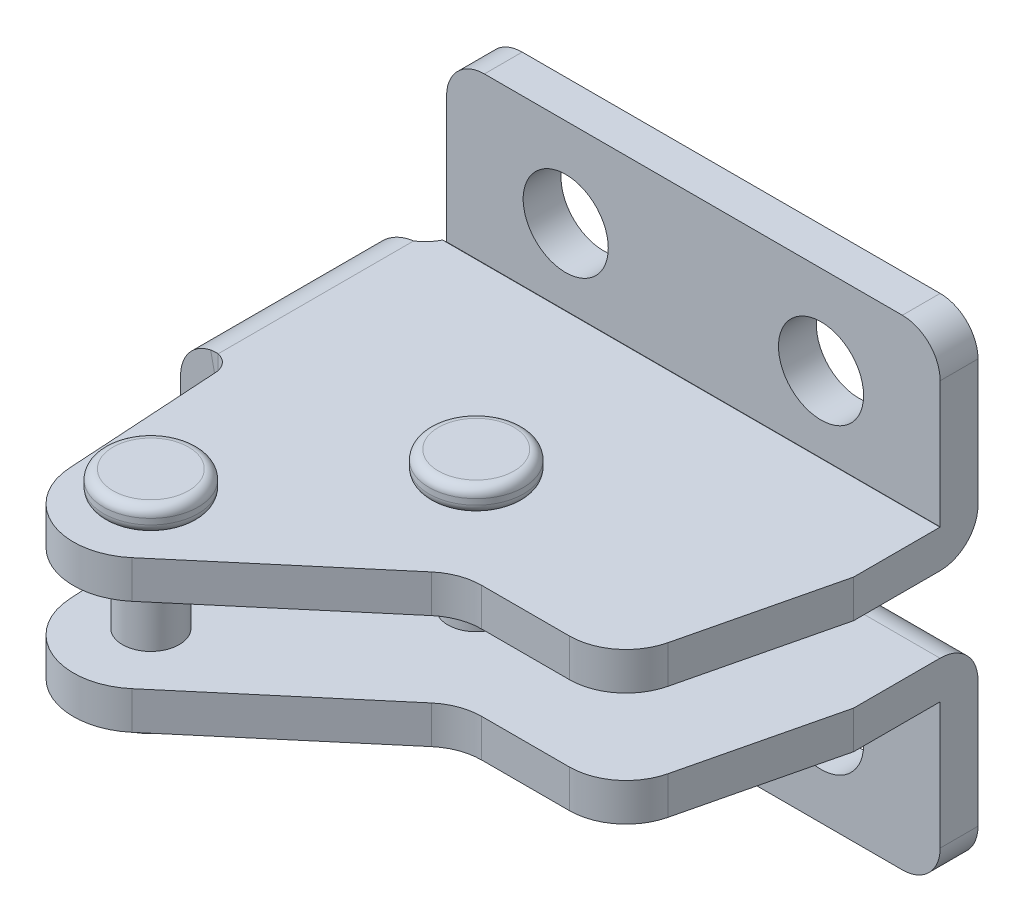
ISO-10303-21;
HEADER;
FILE_DESCRIPTION(('STEP AP214'),'2;1');
FILE_NAME('part.step','',(''),(''),'','','');
FILE_SCHEMA(('AUTOMOTIVE_DESIGN { 1 0 10303 214 1 1 1 1 }'));
ENDSEC;
DATA;
#1=APPLICATION_CONTEXT('core data for automotive mechanical design processes');
#2=APPLICATION_PROTOCOL_DEFINITION('international standard','automotive_design',2000,#1);
#3=PRODUCT_CONTEXT('',#1,'mechanical');
#4=PRODUCT('Part','Part','',(#3));
#5=PRODUCT_RELATED_PRODUCT_CATEGORY('part','',(#4));
#6=PRODUCT_DEFINITION_FORMATION('','',#4);
#7=PRODUCT_DEFINITION_CONTEXT('part definition',#1,'design');
#8=PRODUCT_DEFINITION('design','',#6,#7);
#9=PRODUCT_DEFINITION_SHAPE('','',#8);
#10=(LENGTH_UNIT() NAMED_UNIT(*) SI_UNIT(.MILLI.,.METRE.));
#11=(NAMED_UNIT(*) PLANE_ANGLE_UNIT() SI_UNIT($,.RADIAN.));
#12=(NAMED_UNIT(*) SI_UNIT($,.STERADIAN.) SOLID_ANGLE_UNIT());
#13=UNCERTAINTY_MEASURE_WITH_UNIT(LENGTH_MEASURE(1.E-05),#10,'distance_accuracy_value','');
#14=(GEOMETRIC_REPRESENTATION_CONTEXT(3) GLOBAL_UNCERTAINTY_ASSIGNED_CONTEXT((#13)) GLOBAL_UNIT_ASSIGNED_CONTEXT((#10,
#11,#12)) REPRESENTATION_CONTEXT('',''));
#15=CARTESIAN_POINT('',(0.,0.,0.));
#16=DIRECTION('',(0.,0.,1.));
#17=DIRECTION('',(1.,0.,0.));
#18=AXIS2_PLACEMENT_3D('',#15,#16,#17);
#19=CARTESIAN_POINT('',(5.26820548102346,4.,12.0000960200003));
#20=DIRECTION('',(0.,1.,0.));
#21=DIRECTION('',(0.882613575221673,0.,0.470099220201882));
#22=AXIS2_PLACEMENT_3D('',#19,#20,#21);
#23=CYLINDRICAL_SURFACE('',#22,1.5);
#24=CARTESIAN_POINT('',(5.26820548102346,6.00000000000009,12.0000960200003));
#25=DIRECTION('',(0.,1.,0.));
#26=DIRECTION('',(-1.,0.,6.93590386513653E-12));
#27=AXIS2_PLACEMENT_3D('',#24,#25,#26);
#28=CIRCLE('',#27,1.5);
#29=CARTESIAN_POINT('',(3.76820548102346,6.00000000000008,12.0000960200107));
#30=VERTEX_POINT('',#29);
#31=EDGE_CURVE('E9',#30,#30,#28,.F.);
#32=ORIENTED_EDGE('',*,*,#31,.F.);
#33=EDGE_LOOP('',(#32));
#34=FACE_BOUND('',#33,.T.);
#35=CARTESIAN_POINT('',(5.26820548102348,10.,12.0000960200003));
#36=DIRECTION('',(0.,-1.,0.));
#37=DIRECTION('',(1.,0.,-6.93590386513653E-12));
#38=AXIS2_PLACEMENT_3D('',#35,#36,#37);
#39=CIRCLE('',#38,1.5);
#40=CARTESIAN_POINT('',(6.76820548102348,10.,12.0000960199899));
#41=VERTEX_POINT('',#40);
#42=EDGE_CURVE('E29',#41,#41,#39,.F.);
#43=ORIENTED_EDGE('',*,*,#42,.F.);
#44=EDGE_LOOP('',(#43));
#45=FACE_BOUND('',#44,.T.);
#46=ADVANCED_FACE('F14',(#34,#45),#23,.T.);
#47=CARTESIAN_POINT('',(5.26820548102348,13.3,12.0000960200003));
#48=DIRECTION('',(0.,-1.,0.));
#49=DIRECTION('',(-0.882613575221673,0.,-0.470099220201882));
#50=AXIS2_PLACEMENT_3D('',#47,#48,#49);
#51=PLANE('',#50);
#52=CARTESIAN_POINT('',(5.26820548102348,13.3,12.0000960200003));
#53=DIRECTION('',(0.,-1.,0.));
#54=DIRECTION('',(-0.882613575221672,0.,-0.470099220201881));
#55=AXIS2_PLACEMENT_3D('',#52,#53,#54);
#56=CIRCLE('',#55,1.99999999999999);
#57=CARTESIAN_POINT('',(3.50297833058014,13.3,11.0598975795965));
#58=VERTEX_POINT('',#57);
#59=CARTESIAN_POINT('',(7.03343263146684,13.3,12.9402944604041));
#60=VERTEX_POINT('',#59);
#61=EDGE_CURVE('E2024',#58,#60,#56,.T.);
#62=ORIENTED_EDGE('',*,*,#61,.F.);
#63=CARTESIAN_POINT('',(5.26820548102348,13.3,12.0000960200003));
#64=DIRECTION('',(0.,-1.,0.));
#65=DIRECTION('',(0.882613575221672,0.,0.470099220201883));
#66=AXIS2_PLACEMENT_3D('',#63,#64,#65);
#67=CIRCLE('',#66,1.99999999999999);
#68=EDGE_CURVE('E2025',#60,#58,#67,.T.);
#69=ORIENTED_EDGE('',*,*,#68,.F.);
#70=EDGE_LOOP('',(#62,#69));
#71=FACE_BOUND('',#70,.T.);
#72=ADVANCED_FACE('F510',(#71),#51,.F.);
#73=CARTESIAN_POINT('',(5.26820548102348,12.8,12.0000960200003));
#74=DIRECTION('',(0.,-1.,0.));
#75=DIRECTION('',(-0.882613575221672,0.,-0.470099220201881));
#76=AXIS2_PLACEMENT_3D('',#73,#74,#75);
#77=TOROIDAL_SURFACE('',#76,1.99999999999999,0.5);
#78=ORIENTED_EDGE('',*,*,#61,.T.);
#79=ORIENTED_EDGE('',*,*,#68,.T.);
#80=EDGE_LOOP('',(#78,#79));
#81=FACE_BOUND('',#80,.T.);
#82=CARTESIAN_POINT('',(5.26820548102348,12.8,12.0000960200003));
#83=DIRECTION('',(0.,1.,0.));
#84=DIRECTION('',(0.882613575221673,0.,0.470099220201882));
#85=AXIS2_PLACEMENT_3D('',#82,#83,#84);
#86=CIRCLE('',#85,2.5);
#87=CARTESIAN_POINT('',(7.47473941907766,12.8,13.175344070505));
#88=VERTEX_POINT('',#87);
#89=EDGE_CURVE('E492',#88,#88,#86,.F.);
#90=ORIENTED_EDGE('',*,*,#89,.F.);
#91=EDGE_LOOP('',(#90));
#92=FACE_BOUND('',#91,.T.);
#93=ADVANCED_FACE('F504',(#81,#92),#77,.T.);
#94=CARTESIAN_POINT('',(5.26820548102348,12.,12.0000960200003));
#95=DIRECTION('',(0.,1.,0.));
#96=DIRECTION('',(0.882613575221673,0.,0.470099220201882));
#97=AXIS2_PLACEMENT_3D('',#94,#95,#96);
#98=CYLINDRICAL_SURFACE('',#97,2.5);
#99=CARTESIAN_POINT('',(5.26820548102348,12.5,12.0000960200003));
#100=DIRECTION('',(0.,-1.,0.));
#101=DIRECTION('',(-0.882613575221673,0.,-0.470099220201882));
#102=AXIS2_PLACEMENT_3D('',#99,#100,#101);
#103=CIRCLE('',#102,2.5);
#104=CARTESIAN_POINT('',(3.0616715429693,12.5,10.8248479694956));
#105=VERTEX_POINT('',#104);
#106=EDGE_CURVE('E484',#105,#105,#103,.T.);
#107=ORIENTED_EDGE('',*,*,#106,.F.);
#108=EDGE_LOOP('',(#107));
#109=FACE_BOUND('',#108,.T.);
#110=ORIENTED_EDGE('',*,*,#89,.T.);
#111=EDGE_LOOP('',(#110));
#112=FACE_BOUND('',#111,.T.);
#113=ADVANCED_FACE('F509',(#109,#112),#98,.T.);
#114=CARTESIAN_POINT('',(5.26820548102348,12.5,12.0000960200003));
#115=DIRECTION('',(0.,-1.,0.));
#116=DIRECTION('',(-0.882613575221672,0.,-0.470099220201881));
#117=AXIS2_PLACEMENT_3D('',#114,#115,#116);
#118=TOROIDAL_SURFACE('',#117,1.99999999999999,0.5);
#119=ORIENTED_EDGE('',*,*,#106,.T.);
#120=EDGE_LOOP('',(#119));
#121=FACE_BOUND('',#120,.T.);
#122=CARTESIAN_POINT('',(5.26820548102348,12.,12.0000960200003));
#123=DIRECTION('',(0.,1.,0.));
#124=DIRECTION('',(-0.882613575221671,0.,-0.470099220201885));
#125=AXIS2_PLACEMENT_3D('',#122,#123,#124);
#126=CIRCLE('',#125,1.99999999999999);
#127=CARTESIAN_POINT('',(7.03343263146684,12.,12.9402944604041));
#128=VERTEX_POINT('',#127);
#129=CARTESIAN_POINT('',(3.50297833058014,12.,11.0598975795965));
#130=VERTEX_POINT('',#129);
#131=EDGE_CURVE('E37',#128,#130,#126,.F.);
#132=ORIENTED_EDGE('',*,*,#131,.F.);
#133=CARTESIAN_POINT('',(5.26820548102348,12.,12.0000960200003));
#134=DIRECTION('',(0.,1.,0.));
#135=DIRECTION('',(0.882613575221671,0.,0.470099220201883));
#136=AXIS2_PLACEMENT_3D('',#133,#134,#135);
#137=CIRCLE('',#136,1.99999999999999);
#138=EDGE_CURVE('E485',#130,#128,#137,.F.);
#139=ORIENTED_EDGE('',*,*,#138,.F.);
#140=EDGE_LOOP('',(#132,#139));
#141=FACE_BOUND('',#140,.T.);
#142=ADVANCED_FACE('F1139',(#121,#141),#118,.T.);
#143=CARTESIAN_POINT('',(5.26820548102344,2.7,12.0000960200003));
#144=DIRECTION('',(0.,1.,0.));
#145=DIRECTION('',(0.882613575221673,0.,0.470099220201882));
#146=AXIS2_PLACEMENT_3D('',#143,#144,#145);
#147=PLANE('',#146);
#148=CARTESIAN_POINT('',(5.26820548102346,2.7,12.0000960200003));
#149=DIRECTION('',(0.,1.,0.));
#150=DIRECTION('',(0.882613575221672,0.,0.470099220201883));
#151=AXIS2_PLACEMENT_3D('',#148,#149,#150);
#152=CIRCLE('',#151,1.99999999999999);
#153=CARTESIAN_POINT('',(7.03343263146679,2.7,12.9402944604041));
#154=VERTEX_POINT('',#153);
#155=CARTESIAN_POINT('',(3.5029783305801,2.7,11.0598975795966));
#156=VERTEX_POINT('',#155);
#157=EDGE_CURVE('E537',#154,#156,#152,.T.);
#158=ORIENTED_EDGE('',*,*,#157,.F.);
#159=CARTESIAN_POINT('',(5.26820548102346,2.7,12.0000960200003));
#160=DIRECTION('',(0.,1.,0.));
#161=DIRECTION('',(-0.882613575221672,0.,-0.470099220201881));
#162=AXIS2_PLACEMENT_3D('',#159,#160,#161);
#163=CIRCLE('',#162,1.99999999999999);
#164=EDGE_CURVE('E2004',#156,#154,#163,.T.);
#165=ORIENTED_EDGE('',*,*,#164,.F.);
#166=EDGE_LOOP('',(#158,#165));
#167=FACE_BOUND('',#166,.T.);
#168=ADVANCED_FACE('F1549',(#167),#147,.F.);
#169=CARTESIAN_POINT('',(5.26820548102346,3.2,12.0000960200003));
#170=DIRECTION('',(0.,1.,0.));
#171=DIRECTION('',(0.882613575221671,0.,0.470099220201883));
#172=AXIS2_PLACEMENT_3D('',#169,#170,#171);
#173=TOROIDAL_SURFACE('',#172,1.99999999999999,0.5);
#174=ORIENTED_EDGE('',*,*,#157,.T.);
#175=ORIENTED_EDGE('',*,*,#164,.T.);
#176=EDGE_LOOP('',(#174,#175));
#177=FACE_BOUND('',#176,.T.);
#178=CARTESIAN_POINT('',(5.26820548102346,3.2,12.0000960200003));
#179=DIRECTION('',(0.,-1.,0.));
#180=DIRECTION('',(-0.882613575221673,0.,-0.470099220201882));
#181=AXIS2_PLACEMENT_3D('',#178,#179,#180);
#182=CIRCLE('',#181,2.5);
#183=CARTESIAN_POINT('',(3.06167154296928,3.2,10.8248479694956));
#184=VERTEX_POINT('',#183);
#185=EDGE_CURVE('E2028',#184,#184,#182,.F.);
#186=ORIENTED_EDGE('',*,*,#185,.F.);
#187=EDGE_LOOP('',(#186));
#188=FACE_BOUND('',#187,.T.);
#189=ADVANCED_FACE('F514',(#177,#188),#173,.T.);
#190=CARTESIAN_POINT('',(5.26820548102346,4.,12.0000960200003));
#191=DIRECTION('',(0.,-1.,0.));
#192=DIRECTION('',(-0.882613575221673,0.,-0.470099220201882));
#193=AXIS2_PLACEMENT_3D('',#190,#191,#192);
#194=CYLINDRICAL_SURFACE('',#193,2.5);
#195=CARTESIAN_POINT('',(5.26820548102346,3.5,12.0000960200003));
#196=DIRECTION('',(0.,1.,0.));
#197=DIRECTION('',(0.882613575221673,0.,0.470099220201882));
#198=AXIS2_PLACEMENT_3D('',#195,#196,#197);
#199=CIRCLE('',#198,2.5);
#200=CARTESIAN_POINT('',(7.47473941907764,3.5,13.175344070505));
#201=VERTEX_POINT('',#200);
#202=EDGE_CURVE('E487',#201,#201,#199,.T.);
#203=ORIENTED_EDGE('',*,*,#202,.F.);
#204=EDGE_LOOP('',(#203));
#205=FACE_BOUND('',#204,.T.);
#206=ORIENTED_EDGE('',*,*,#185,.T.);
#207=EDGE_LOOP('',(#206));
#208=FACE_BOUND('',#207,.T.);
#209=ADVANCED_FACE('F512',(#205,#208),#194,.T.);
#210=CARTESIAN_POINT('',(5.26820548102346,3.5,12.0000960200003));
#211=DIRECTION('',(0.,1.,0.));
#212=DIRECTION('',(0.882613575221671,0.,0.470099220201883));
#213=AXIS2_PLACEMENT_3D('',#210,#211,#212);
#214=TOROIDAL_SURFACE('',#213,1.99999999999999,0.5);
#215=ORIENTED_EDGE('',*,*,#202,.T.);
#216=EDGE_LOOP('',(#215));
#217=FACE_BOUND('',#216,.T.);
#218=CARTESIAN_POINT('',(5.26820548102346,4.,12.0000960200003));
#219=DIRECTION('',(0.,-1.,0.));
#220=DIRECTION('',(0.882613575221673,0.,0.47009922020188));
#221=AXIS2_PLACEMENT_3D('',#218,#219,#220);
#222=CIRCLE('',#221,1.99999999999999);
#223=CARTESIAN_POINT('',(3.50297833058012,4.,11.0598975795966));
#224=VERTEX_POINT('',#223);
#225=CARTESIAN_POINT('',(7.03343263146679,4.,12.9402944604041));
#226=VERTEX_POINT('',#225);
#227=EDGE_CURVE('E481',#224,#226,#222,.F.);
#228=ORIENTED_EDGE('',*,*,#227,.F.);
#229=CARTESIAN_POINT('',(5.26820548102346,4.,12.0000960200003));
#230=DIRECTION('',(0.,-1.,0.));
#231=DIRECTION('',(-0.882613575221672,0.,-0.470099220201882));
#232=AXIS2_PLACEMENT_3D('',#229,#230,#231);
#233=CIRCLE('',#232,1.99999999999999);
#234=EDGE_CURVE('E480',#226,#224,#233,.F.);
#235=ORIENTED_EDGE('',*,*,#234,.F.);
#236=EDGE_LOOP('',(#228,#235));
#237=FACE_BOUND('',#236,.T.);
#238=ADVANCED_FACE('F1133',(#217,#237),#214,.T.);
#239=CARTESIAN_POINT('',(-2.43173415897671,2.7,21.5058015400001));
#240=DIRECTION('',(0.,1.,0.));
#241=DIRECTION('',(-0.933181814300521,0.,-0.359404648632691));
#242=AXIS2_PLACEMENT_3D('',#239,#240,#241);
#243=PLANE('',#242);
#244=CARTESIAN_POINT('',(-2.43173415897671,2.7,21.5058015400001));
#245=DIRECTION('',(0.,1.,0.));
#246=DIRECTION('',(-0.933181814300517,0.,-0.3594046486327));
#247=AXIS2_PLACEMENT_3D('',#244,#245,#246);
#248=CIRCLE('',#247,2.);
#249=CARTESIAN_POINT('',(-4.29809778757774,2.7,20.7869922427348));
#250=VERTEX_POINT('',#249);
#251=CARTESIAN_POINT('',(-0.565370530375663,2.7,22.2246108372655));
#252=VERTEX_POINT('',#251);
#253=EDGE_CURVE('E676',#250,#252,#248,.T.);
#254=ORIENTED_EDGE('',*,*,#253,.F.);
#255=CARTESIAN_POINT('',(-2.43173415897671,2.7,21.5058015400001));
#256=DIRECTION('',(0.,1.,0.));
#257=DIRECTION('',(0.933181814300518,0.,0.359404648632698));
#258=AXIS2_PLACEMENT_3D('',#255,#256,#257);
#259=CIRCLE('',#258,2.);
#260=EDGE_CURVE('E687',#252,#250,#259,.T.);
#261=ORIENTED_EDGE('',*,*,#260,.F.);
#262=EDGE_LOOP('',(#254,#261));
#263=FACE_BOUND('',#262,.T.);
#264=ADVANCED_FACE('F653',(#263),#243,.F.);
#265=CARTESIAN_POINT('',(-2.43173415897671,13.3,21.5058015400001));
#266=DIRECTION('',(0.,-1.,0.));
#267=DIRECTION('',(0.933181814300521,0.,0.359404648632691));
#268=AXIS2_PLACEMENT_3D('',#265,#266,#267);
#269=PLANE('',#268);
#270=CARTESIAN_POINT('',(-2.43173415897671,13.3,21.5058015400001));
#271=DIRECTION('',(0.,-1.,0.));
#272=DIRECTION('',(0.933181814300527,0.,0.359404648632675));
#273=AXIS2_PLACEMENT_3D('',#270,#271,#272);
#274=CIRCLE('',#273,1.99999999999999);
#275=CARTESIAN_POINT('',(-0.565370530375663,13.3,22.2246108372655));
#276=VERTEX_POINT('',#275);
#277=CARTESIAN_POINT('',(-4.29809778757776,13.3,20.7869922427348));
#278=VERTEX_POINT('',#277);
#279=EDGE_CURVE('E599',#276,#278,#274,.T.);
#280=ORIENTED_EDGE('',*,*,#279,.F.);
#281=CARTESIAN_POINT('',(-2.43173415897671,13.3,21.5058015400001));
#282=DIRECTION('',(0.,-1.,0.));
#283=DIRECTION('',(-0.933181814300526,0.,-0.359404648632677));
#284=AXIS2_PLACEMENT_3D('',#281,#282,#283);
#285=CIRCLE('',#284,1.99999999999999);
#286=EDGE_CURVE('E638',#278,#276,#285,.T.);
#287=ORIENTED_EDGE('',*,*,#286,.F.);
#288=EDGE_LOOP('',(#280,#287));
#289=FACE_BOUND('',#288,.T.);
#290=ADVANCED_FACE('F619',(#289),#269,.F.);
#291=CARTESIAN_POINT('',(-2.43173415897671,3.2,21.5058015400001));
#292=DIRECTION('',(0.,1.,0.));
#293=DIRECTION('',(-0.933181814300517,0.,-0.3594046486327));
#294=AXIS2_PLACEMENT_3D('',#291,#292,#293);
#295=TOROIDAL_SURFACE('',#294,2.,0.5);
#296=ORIENTED_EDGE('',*,*,#253,.T.);
#297=ORIENTED_EDGE('',*,*,#260,.T.);
#298=EDGE_LOOP('',(#296,#297));
#299=FACE_BOUND('',#298,.T.);
#300=CARTESIAN_POINT('',(-2.43173415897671,3.2,21.5058015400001));
#301=DIRECTION('',(0.,-1.,0.));
#302=DIRECTION('',(0.933181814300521,0.,0.359404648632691));
#303=AXIS2_PLACEMENT_3D('',#300,#301,#302);
#304=CIRCLE('',#303,2.5);
#305=CARTESIAN_POINT('',(-0.0987796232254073,3.2,22.4043131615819));
#306=VERTEX_POINT('',#305);
#307=EDGE_CURVE('E633',#306,#306,#304,.F.);
#308=ORIENTED_EDGE('',*,*,#307,.F.);
#309=EDGE_LOOP('',(#308));
#310=FACE_BOUND('',#309,.T.);
#311=ADVANCED_FACE('F618',(#299,#310),#295,.T.);
#312=CARTESIAN_POINT('',(-2.43173415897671,12.8,21.5058015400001));
#313=DIRECTION('',(0.,-1.,0.));
#314=DIRECTION('',(0.933181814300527,0.,0.359404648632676));
#315=AXIS2_PLACEMENT_3D('',#312,#313,#314);
#316=TOROIDAL_SURFACE('',#315,1.99999999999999,0.5);
#317=ORIENTED_EDGE('',*,*,#279,.T.);
#318=ORIENTED_EDGE('',*,*,#286,.T.);
#319=EDGE_LOOP('',(#317,#318));
#320=FACE_BOUND('',#319,.T.);
#321=CARTESIAN_POINT('',(-2.43173415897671,12.8,21.5058015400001));
#322=DIRECTION('',(0.,1.,0.));
#323=DIRECTION('',(-0.933181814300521,0.,-0.359404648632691));
#324=AXIS2_PLACEMENT_3D('',#321,#322,#323);
#325=CIRCLE('',#324,2.5);
#326=CARTESIAN_POINT('',(-4.76468869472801,12.8,20.6072899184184));
#327=VERTEX_POINT('',#326);
#328=EDGE_CURVE('E631',#327,#327,#325,.F.);
#329=ORIENTED_EDGE('',*,*,#328,.F.);
#330=EDGE_LOOP('',(#329));
#331=FACE_BOUND('',#330,.T.);
#332=ADVANCED_FACE('F606',(#320,#331),#316,.T.);
#333=CARTESIAN_POINT('',(0.,0.,2.));
#334=DIRECTION('',(0.,0.,1.));
#335=DIRECTION('',(1.,0.,0.));
#336=AXIS2_PLACEMENT_3D('',#333,#334,#335);
#337=CYLINDRICAL_SURFACE('',#336,2.25);
#338=CARTESIAN_POINT('',(0.,0.,0.));
#339=DIRECTION('',(0.,0.,1.));
#340=DIRECTION('',(1.,0.,0.));
#341=AXIS2_PLACEMENT_3D('',#338,#339,#340);
#342=CIRCLE('',#341,2.25);
#343=CARTESIAN_POINT('',(2.25,0.,0.));
#344=VERTEX_POINT('',#343);
#345=EDGE_CURVE('E1839',#344,#344,#342,.T.);
#346=ORIENTED_EDGE('',*,*,#345,.F.);
#347=EDGE_LOOP('',(#346));
#348=FACE_BOUND('',#347,.T.);
#349=CARTESIAN_POINT('',(0.,0.,2.));
#350=DIRECTION('',(0.,0.,1.));
#351=DIRECTION('',(1.,0.,0.));
#352=AXIS2_PLACEMENT_3D('',#349,#350,#351);
#353=CIRCLE('',#352,2.25);
#354=CARTESIAN_POINT('',(2.24999999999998,0.,2.00000000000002));
#355=VERTEX_POINT('',#354);
#356=EDGE_CURVE('E1746',#355,#355,#353,.F.);
#357=ORIENTED_EDGE('',*,*,#356,.F.);
#358=EDGE_LOOP('',(#357));
#359=FACE_BOUND('',#358,.T.);
#360=ADVANCED_FACE('F617',(#348,#359),#337,.F.);
#361=CARTESIAN_POINT('',(13.5,0.,2.00000000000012));
#362=DIRECTION('',(0.,0.,1.));
#363=DIRECTION('',(1.,0.,0.));
#364=AXIS2_PLACEMENT_3D('',#361,#362,#363);
#365=CYLINDRICAL_SURFACE('',#364,2.25);
#366=CARTESIAN_POINT('',(13.5,0.,1.14925430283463E-13));
#367=DIRECTION('',(0.,0.,1.));
#368=DIRECTION('',(1.,0.,0.));
#369=AXIS2_PLACEMENT_3D('',#366,#367,#368);
#370=CIRCLE('',#369,2.25);
#371=CARTESIAN_POINT('',(15.75,1.12677314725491E-13,1.33150277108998E-13));
#372=VERTEX_POINT('',#371);
#373=EDGE_CURVE('E779',#372,#372,#370,.T.);
#374=ORIENTED_EDGE('',*,*,#373,.F.);
#375=EDGE_LOOP('',(#374));
#376=FACE_BOUND('',#375,.T.);
#377=CARTESIAN_POINT('',(13.5,0.,2.00000000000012));
#378=DIRECTION('',(0.,0.,1.));
#379=DIRECTION('',(1.,0.,0.));
#380=AXIS2_PLACEMENT_3D('',#377,#378,#379);
#381=CIRCLE('',#380,2.25);
#382=CARTESIAN_POINT('',(15.75,1.12677314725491E-13,2.00000000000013));
#383=VERTEX_POINT('',#382);
#384=EDGE_CURVE('E873',#383,#383,#381,.F.);
#385=ORIENTED_EDGE('',*,*,#384,.F.);
#386=EDGE_LOOP('',(#385));
#387=FACE_BOUND('',#386,.T.);
#388=ADVANCED_FACE('F1164',(#376,#387),#365,.F.);
#389=CARTESIAN_POINT('',(17.8,-4.6999999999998,1.60461921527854E-13));
#390=DIRECTION('',(0.,1.,0.));
#391=DIRECTION('',(-1.,0.,0.));
#392=AXIS2_PLACEMENT_3D('',#389,#390,#391);
#393=PLANE('',#392);
#394=DIRECTION('',(0.,0.,1.));
#395=VECTOR('',#394,1.);
#396=CARTESIAN_POINT('',(-4.3,-4.6999999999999,0.));
#397=LINE('',#396,#395);
#398=CARTESIAN_POINT('',(-4.3,-4.6999999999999,0.));
#399=VERTEX_POINT('',#398);
#400=CARTESIAN_POINT('',(-4.3,-4.6999999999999,2.));
#401=VERTEX_POINT('',#400);
#402=EDGE_CURVE('E792',#399,#401,#397,.T.);
#403=ORIENTED_EDGE('',*,*,#402,.F.);
#404=DIRECTION('',(-1.,0.,0.));
#405=VECTOR('',#404,1.);
#406=CARTESIAN_POINT('',(14.9808750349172,-4.69999999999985,1.38561037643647E-13));
#407=LINE('',#406,#405);
#408=CARTESIAN_POINT('',(17.8,-4.6999999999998,1.60461921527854E-13));
#409=VERTEX_POINT('',#408);
#410=EDGE_CURVE('E769',#409,#399,#407,.T.);
#411=ORIENTED_EDGE('',*,*,#410,.F.);
#412=DIRECTION('',(0.,0.,1.));
#413=VECTOR('',#412,1.);
#414=CARTESIAN_POINT('',(17.8,-4.6999999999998,1.60461921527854E-13));
#415=LINE('',#414,#413);
#416=CARTESIAN_POINT('',(17.8,-4.6999999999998,2.00000000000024));
#417=VERTEX_POINT('',#416);
#418=EDGE_CURVE('E797',#417,#409,#415,.F.);
#419=ORIENTED_EDGE('',*,*,#418,.F.);
#420=DIRECTION('',(-1.,0.,0.));
#421=VECTOR('',#420,1.);
#422=CARTESIAN_POINT('',(17.8,-4.6999999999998,2.00000000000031));
#423=LINE('',#422,#421);
#424=EDGE_CURVE('E799',#401,#417,#423,.F.);
#425=ORIENTED_EDGE('',*,*,#424,.F.);
#426=EDGE_LOOP('',(#403,#411,#419,#425));
#427=FACE_BOUND('',#426,.T.);
#428=ADVANCED_FACE('F1174',(#427),#393,.F.);
#429=CARTESIAN_POINT('',(-4.3,-2.69999999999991,0.));
#430=DIRECTION('',(0.,0.,1.));
#431=DIRECTION('',(1.,0.,0.));
#432=AXIS2_PLACEMENT_3D('',#429,#430,#431);
#433=CYLINDRICAL_SURFACE('',#432,2.);
#434=CARTESIAN_POINT('',(-4.3,-2.69999999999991,0.));
#435=DIRECTION('',(0.,0.,1.));
#436=DIRECTION('',(1.,0.,0.));
#437=AXIS2_PLACEMENT_3D('',#434,#435,#436);
#438=CIRCLE('',#437,2.);
#439=CARTESIAN_POINT('',(-6.3,-2.69999999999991,0.));
#440=VERTEX_POINT('',#439);
#441=EDGE_CURVE('E768',#399,#440,#438,.F.);
#442=ORIENTED_EDGE('',*,*,#441,.F.);
#443=ORIENTED_EDGE('',*,*,#402,.T.);
#444=CARTESIAN_POINT('',(-4.3,-2.69999999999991,1.99999999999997));
#445=DIRECTION('',(0.,0.,1.));
#446=DIRECTION('',(1.,0.,0.));
#447=AXIS2_PLACEMENT_3D('',#444,#445,#446);
#448=CIRCLE('',#447,2.);
#449=CARTESIAN_POINT('',(-6.3,-2.69999999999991,1.99999999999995));
#450=VERTEX_POINT('',#449);
#451=EDGE_CURVE('E793',#401,#450,#448,.F.);
#452=ORIENTED_EDGE('',*,*,#451,.T.);
#453=DIRECTION('',(0.,0.,1.));
#454=VECTOR('',#453,1.);
#455=CARTESIAN_POINT('',(-6.3,-2.69999999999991,0.));
#456=LINE('',#455,#454);
#457=EDGE_CURVE('E789',#450,#440,#456,.F.);
#458=ORIENTED_EDGE('',*,*,#457,.T.);
#459=EDGE_LOOP('',(#442,#443,#452,#458));
#460=FACE_BOUND('',#459,.T.);
#461=ADVANCED_FACE('F1184',(#460),#433,.T.);
#462=CARTESIAN_POINT('',(-1.40512601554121E-13,16.,1.99999999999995));
#463=DIRECTION('',(0.,0.,1.));
#464=DIRECTION('',(1.,0.,0.));
#465=AXIS2_PLACEMENT_3D('',#462,#463,#464);
#466=CYLINDRICAL_SURFACE('',#465,2.25);
#467=CARTESIAN_POINT('',(-1.21430643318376E-13,16.,1.09504419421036E-13));
#468=DIRECTION('',(0.,0.,1.));
#469=DIRECTION('',(1.,0.,0.));
#470=AXIS2_PLACEMENT_3D('',#467,#468,#469);
#471=CIRCLE('',#470,2.25);
#472=CARTESIAN_POINT('',(2.24999999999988,16.,1.27729266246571E-13));
#473=VERTEX_POINT('',#472);
#474=EDGE_CURVE('E1090',#473,#473,#471,.T.);
#475=ORIENTED_EDGE('',*,*,#474,.F.);
#476=EDGE_LOOP('',(#475));
#477=FACE_BOUND('',#476,.T.);
#478=CARTESIAN_POINT('',(-1.40512601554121E-13,16.,1.99999999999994));
#479=DIRECTION('',(0.,0.,1.));
#480=DIRECTION('',(1.,0.,0.));
#481=AXIS2_PLACEMENT_3D('',#478,#479,#480);
#482=CIRCLE('',#481,2.25);
#483=CARTESIAN_POINT('',(2.24999999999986,16.,1.99999999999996));
#484=VERTEX_POINT('',#483);
#485=EDGE_CURVE('E1101',#484,#484,#482,.F.);
#486=ORIENTED_EDGE('',*,*,#485,.F.);
#487=EDGE_LOOP('',(#486));
#488=FACE_BOUND('',#487,.T.);
#489=ADVANCED_FACE('F1193',(#477,#488),#466,.F.);
#490=CARTESIAN_POINT('',(13.4999999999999,16.,2.00000000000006));
#491=DIRECTION('',(0.,0.,1.));
#492=DIRECTION('',(1.,0.,0.));
#493=AXIS2_PLACEMENT_3D('',#490,#491,#492);
#494=CYLINDRICAL_SURFACE('',#493,2.25);
#495=CARTESIAN_POINT('',(13.5,16.,1.59811400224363E-13));
#496=DIRECTION('',(0.,0.,1.));
#497=DIRECTION('',(1.,0.,0.));
#498=AXIS2_PLACEMENT_3D('',#495,#496,#497);
#499=CIRCLE('',#498,2.25);
#500=CARTESIAN_POINT('',(15.75,16.,1.78036247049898E-13));
#501=VERTEX_POINT('',#500);
#502=EDGE_CURVE('E1086',#501,#501,#499,.T.);
#503=ORIENTED_EDGE('',*,*,#502,.F.);
#504=EDGE_LOOP('',(#503));
#505=FACE_BOUND('',#504,.T.);
#506=CARTESIAN_POINT('',(13.4999999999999,16.,2.00000000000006));
#507=DIRECTION('',(0.,0.,1.));
#508=DIRECTION('',(1.,0.,0.));
#509=AXIS2_PLACEMENT_3D('',#506,#507,#508);
#510=CIRCLE('',#509,2.25);
#511=CARTESIAN_POINT('',(15.7499999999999,16.,2.00000000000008));
#512=VERTEX_POINT('',#511);
#513=EDGE_CURVE('E393',#512,#512,#510,.F.);
#514=ORIENTED_EDGE('',*,*,#513,.F.);
#515=EDGE_LOOP('',(#514));
#516=FACE_BOUND('',#515,.T.);
#517=ADVANCED_FACE('F1203',(#505,#516),#494,.F.);
#518=CARTESIAN_POINT('',(-4.30000000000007,20.7,1.08853898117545E-13));
#519=DIRECTION('',(0.,-1.,0.));
#520=DIRECTION('',(1.,0.,0.));
#521=AXIS2_PLACEMENT_3D('',#518,#519,#520);
#522=PLANE('',#521);
#523=DIRECTION('',(0.,0.,1.));
#524=VECTOR('',#523,1.);
#525=CARTESIAN_POINT('',(17.8,20.7,1.95373231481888E-13));
#526=LINE('',#525,#524);
#527=CARTESIAN_POINT('',(17.8,20.7,1.95373231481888E-13));
#528=VERTEX_POINT('',#527);
#529=CARTESIAN_POINT('',(17.8,20.7,2.0000000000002));
#530=VERTEX_POINT('',#529);
#531=EDGE_CURVE('E386',#528,#530,#526,.T.);
#532=ORIENTED_EDGE('',*,*,#531,.F.);
#533=DIRECTION('',(-1.,0.,0.));
#534=VECTOR('',#533,1.);
#535=CARTESIAN_POINT('',(-36.5791738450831,20.7,0.));
#536=LINE('',#535,#534);
#537=CARTESIAN_POINT('',(-4.30000000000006,20.7,1.08853898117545E-13));
#538=VERTEX_POINT('',#537);
#539=EDGE_CURVE('E381',#538,#528,#536,.F.);
#540=ORIENTED_EDGE('',*,*,#539,.F.);
#541=DIRECTION('',(0.,0.,1.));
#542=VECTOR('',#541,1.);
#543=CARTESIAN_POINT('',(-4.30000000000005,20.7,1.08853898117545E-13));
#544=LINE('',#543,#542);
#545=CARTESIAN_POINT('',(-4.30000000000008,20.7,2.));
#546=VERTEX_POINT('',#545);
#547=EDGE_CURVE('E365',#546,#538,#544,.F.);
#548=ORIENTED_EDGE('',*,*,#547,.F.);
#549=DIRECTION('',(1.,0.,0.));
#550=VECTOR('',#549,1.);
#551=CARTESIAN_POINT('',(-4.3000000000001,20.7,1.99999999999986));
#552=LINE('',#551,#550);
#553=EDGE_CURVE('E371',#530,#546,#552,.F.);
#554=ORIENTED_EDGE('',*,*,#553,.F.);
#555=EDGE_LOOP('',(#532,#540,#548,#554));
#556=FACE_BOUND('',#555,.T.);
#557=ADVANCED_FACE('F379',(#556),#522,.F.);
#558=CARTESIAN_POINT('',(-4.30000000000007,18.7,1.03866568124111E-13));
#559=DIRECTION('',(0.,0.,1.));
#560=DIRECTION('',(1.,0.,0.));
#561=AXIS2_PLACEMENT_3D('',#558,#559,#560);
#562=CYLINDRICAL_SURFACE('',#561,2.);
#563=CARTESIAN_POINT('',(-4.30000000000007,18.7,1.03866568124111E-13));
#564=DIRECTION('',(0.,0.,1.));
#565=DIRECTION('',(1.,0.,0.));
#566=AXIS2_PLACEMENT_3D('',#563,#564,#565);
#567=CIRCLE('',#566,2.);
#568=CARTESIAN_POINT('',(-6.30000000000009,18.7,0.));
#569=VERTEX_POINT('',#568);
#570=EDGE_CURVE('E1083',#569,#538,#567,.F.);
#571=ORIENTED_EDGE('',*,*,#570,.F.);
#572=DIRECTION('',(0.,0.,1.));
#573=VECTOR('',#572,1.);
#574=CARTESIAN_POINT('',(-6.30000000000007,18.7,1.00830802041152E-13));
#575=LINE('',#574,#573);
#576=CARTESIAN_POINT('',(-6.30000000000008,18.7,2.0000000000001));
#577=VERTEX_POINT('',#576);
#578=EDGE_CURVE('E367',#569,#577,#575,.T.);
#579=ORIENTED_EDGE('',*,*,#578,.T.);
#580=CARTESIAN_POINT('',(-4.30000000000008,18.7,2.0000000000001));
#581=DIRECTION('',(0.,0.,1.));
#582=DIRECTION('',(1.,0.,0.));
#583=AXIS2_PLACEMENT_3D('',#580,#581,#582);
#584=CIRCLE('',#583,2.);
#585=EDGE_CURVE('E358',#577,#546,#584,.F.);
#586=ORIENTED_EDGE('',*,*,#585,.T.);
#587=ORIENTED_EDGE('',*,*,#547,.T.);
#588=EDGE_LOOP('',(#571,#579,#586,#587));
#589=FACE_BOUND('',#588,.T.);
#590=ADVANCED_FACE('F363',(#589),#562,.T.);
#591=CARTESIAN_POINT('',(-2.43173415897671,4.,21.5058015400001));
#592=DIRECTION('',(0.,-1.,0.));
#593=DIRECTION('',(0.933181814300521,0.,0.359404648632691));
#594=AXIS2_PLACEMENT_3D('',#591,#592,#593);
#595=CYLINDRICAL_SURFACE('',#594,2.5);
#596=CARTESIAN_POINT('',(-2.43173415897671,3.5,21.5058015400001));
#597=DIRECTION('',(0.,1.,0.));
#598=DIRECTION('',(-0.933181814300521,0.,-0.359404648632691));
#599=AXIS2_PLACEMENT_3D('',#596,#597,#598);
#600=CIRCLE('',#599,2.5);
#601=CARTESIAN_POINT('',(-4.76468869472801,3.5,20.6072899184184));
#602=VERTEX_POINT('',#601);
#603=EDGE_CURVE('E629',#602,#602,#600,.T.);
#604=ORIENTED_EDGE('',*,*,#603,.F.);
#605=EDGE_LOOP('',(#604));
#606=FACE_BOUND('',#605,.T.);
#607=ORIENTED_EDGE('',*,*,#307,.T.);
#608=EDGE_LOOP('',(#607));
#609=FACE_BOUND('',#608,.T.);
#610=ADVANCED_FACE('F620',(#606,#609),#595,.T.);
#611=CARTESIAN_POINT('',(-2.43173415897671,12.,21.5058015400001));
#612=DIRECTION('',(0.,1.,0.));
#613=DIRECTION('',(-0.933181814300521,0.,-0.359404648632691));
#614=AXIS2_PLACEMENT_3D('',#611,#612,#613);
#615=CYLINDRICAL_SURFACE('',#614,2.5);
#616=CARTESIAN_POINT('',(-2.43173415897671,12.5,21.5058015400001));
#617=DIRECTION('',(0.,-1.,0.));
#618=DIRECTION('',(0.933181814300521,0.,0.359404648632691));
#619=AXIS2_PLACEMENT_3D('',#616,#617,#618);
#620=CIRCLE('',#619,2.5);
#621=CARTESIAN_POINT('',(-0.0987796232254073,12.5,22.4043131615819));
#622=VERTEX_POINT('',#621);
#623=EDGE_CURVE('E1105',#622,#622,#620,.T.);
#624=ORIENTED_EDGE('',*,*,#623,.F.);
#625=EDGE_LOOP('',(#624));
#626=FACE_BOUND('',#625,.T.);
#627=ORIENTED_EDGE('',*,*,#328,.T.);
#628=EDGE_LOOP('',(#627));
#629=FACE_BOUND('',#628,.T.);
#630=ADVANCED_FACE('F561',(#626,#629),#615,.T.);
#631=CARTESIAN_POINT('',(-9.23264511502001,-17.78002444,13.7899999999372));
#632=DIRECTION('',(1.,0.,0.));
#633=DIRECTION('',(0.,0.,-1.));
#634=AXIS2_PLACEMENT_3D('',#631,#632,#633);
#635=PLANE('',#634);
#636=DIRECTION('',(0.,0.,-1.));
#637=VECTOR('',#636,1.);
#638=CARTESIAN_POINT('',(-9.23264511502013,9.99,13.7899999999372));
#639=LINE('',#638,#637);
#640=CARTESIAN_POINT('',(-9.23264511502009,9.99,3.1334957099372));
#641=VERTEX_POINT('',#640);
#642=CARTESIAN_POINT('',(-9.23264511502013,9.99,13.1334957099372));
#643=VERTEX_POINT('',#642);
#644=EDGE_CURVE('E819',#641,#643,#639,.F.);
#645=ORIENTED_EDGE('',*,*,#644,.F.);
#646=DIRECTION('',(0.,1.,0.));
#647=VECTOR('',#646,1.);
#648=CARTESIAN_POINT('',(-9.23264511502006,5.5008505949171,3.1334957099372));
#649=LINE('',#648,#647);
#650=CARTESIAN_POINT('',(-9.23264511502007,6.01,3.1334957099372));
#651=VERTEX_POINT('',#650);
#652=EDGE_CURVE('E815',#641,#651,#649,.F.);
#653=ORIENTED_EDGE('',*,*,#652,.T.);
#654=DIRECTION('',(0.,0.,-1.));
#655=VECTOR('',#654,1.);
#656=CARTESIAN_POINT('',(-9.23264511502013,6.01,18.7815591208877));
#657=LINE('',#656,#655);
#658=CARTESIAN_POINT('',(-9.23264511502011,6.01,13.1334957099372));
#659=VERTEX_POINT('',#658);
#660=EDGE_CURVE('E787',#659,#651,#657,.T.);
#661=ORIENTED_EDGE('',*,*,#660,.F.);
#662=DIRECTION('',(0.,1.,0.));
#663=VECTOR('',#662,1.);
#664=CARTESIAN_POINT('',(-9.2326451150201,4.6346220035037,13.1334957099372));
#665=LINE('',#664,#663);
#666=EDGE_CURVE('E818',#659,#643,#665,.T.);
#667=ORIENTED_EDGE('',*,*,#666,.T.);
#668=EDGE_LOOP('',(#645,#653,#661,#667));
#669=FACE_BOUND('',#668,.T.);
#670=ADVANCED_FACE('F1241',(#669),#635,.F.);
#671=CARTESIAN_POINT('',(-7.6439044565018,4.0241901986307,13.1334957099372));
#672=CARTESIAN_POINT('',(-7.52015784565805,3.9979392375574,13.1365842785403));
#673=CARTESIAN_POINT('',(-7.42179202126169,3.98855438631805,13.1400034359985));
#674=CARTESIAN_POINT('',(-7.28062833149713,3.97959614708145,13.1475171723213));
#675=CARTESIAN_POINT('',(-7.23766449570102,3.98,13.1516165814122));
#676=CARTESIAN_POINT('',(-7.2226451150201,3.98,13.1560369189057));
#677=CARTESIAN_POINT('',(-7.63975411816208,4.0437548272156,13.1334957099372));
#678=CARTESIAN_POINT('',(-7.5172266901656,4.01776249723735,13.1365842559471));
#679=CARTESIAN_POINT('',(-7.41982998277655,4.0084701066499,13.1400034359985));
#680=CARTESIAN_POINT('',(-7.28005706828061,3.9996001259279,13.1475171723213));
#681=CARTESIAN_POINT('',(-7.23751652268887,4.,13.1516165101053));
#682=CARTESIAN_POINT('',(-7.2226451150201,4.,13.1560369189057));
#683=CARTESIAN_POINT('',(-7.22472028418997,6.00021768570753,13.1334957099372));
#684=CARTESIAN_POINT('',(-7.22411114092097,6.00008846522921,13.1365819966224));
#685=CARTESIAN_POINT('',(-7.22362613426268,6.00004213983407,13.1400034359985));
#686=CARTESIAN_POINT('',(-7.22293074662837,5.99999801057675,13.1475171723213));
#687=CARTESIAN_POINT('',(-7.22271922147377,6.,13.1516093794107));
#688=CARTESIAN_POINT('',(-7.22264511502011,6.,13.1560369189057));
#689=CARTESIAN_POINT('',(-7.22052844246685,6.01997796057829,13.1334957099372));
#690=CARTESIAN_POINT('',(-7.2211506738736,6.02010995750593,13.1365819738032));
#691=CARTESIAN_POINT('',(-7.22164447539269,6.02015701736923,13.1400034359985));
#692=CARTESIAN_POINT('',(-7.22235377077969,6.02020202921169,13.1475171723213));
#693=CARTESIAN_POINT('',(-7.22256976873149,6.0202,13.1516093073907));
#694=CARTESIAN_POINT('',(-7.22264511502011,6.0202,13.1560369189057));
#695=B_SPLINE_SURFACE_WITH_KNOTS('',1,3,((#671,#672,#673,#674,#675,#676),(#677,#678,#679,#680,
#681,#682),(#683,#684,#685,#686,#687,#688),(#689,#690,#691,#692,#693,#694)),.UNSPECIFIED.,.F.,
.F.,.F.,(2,1,1,2),(4,2,4),(-0.01,0.,1.,1.0101),(0.,0.5,1.),.UNSPECIFIED.);
#696=CARTESIAN_POINT('',(-7.2226451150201,4.,13.1560369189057));
#697=CARTESIAN_POINT('',(-7.22417852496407,3.99999998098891,13.1555924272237));
#698=CARTESIAN_POINT('',(-7.22572648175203,4.00000175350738,13.1552072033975));
#699=CARTESIAN_POINT('',(-7.22883896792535,4.00000894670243,13.1545171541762));
#700=CARTESIAN_POINT('',(-7.23040347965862,4.00001436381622,13.1542122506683));
#701=CARTESIAN_POINT('',(-7.23510395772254,4.0000361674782,13.1533605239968));
#702=CARTESIAN_POINT('',(-7.238250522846,4.00005810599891,13.1528758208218));
#703=CARTESIAN_POINT('',(-7.24769866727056,4.00014628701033,13.1515473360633));
#704=CARTESIAN_POINT('',(-7.25401675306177,4.00023489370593,13.1508276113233));
#705=CARTESIAN_POINT('',(-7.26665836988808,4.00047199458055,13.1495317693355));
#706=CARTESIAN_POINT('',(-7.27298188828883,4.00062042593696,13.1489555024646));
#707=CARTESIAN_POINT('',(-7.28563763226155,4.00097734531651,13.1478931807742));
#708=CARTESIAN_POINT('',(-7.29196986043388,4.00118585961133,13.147407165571));
#709=CARTESIAN_POINT('',(-7.31078971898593,4.00189475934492,13.1460510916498));
#710=CARTESIAN_POINT('',(-7.32328024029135,4.00248188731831,13.1452667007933));
#711=CARTESIAN_POINT('',(-7.34825328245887,4.00388958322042,13.1438305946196));
#712=CARTESIAN_POINT('',(-7.36073580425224,4.00471011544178,13.1431788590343));
#713=CARTESIAN_POINT('',(-7.39819134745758,4.00752379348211,13.1413542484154));
#714=CARTESIAN_POINT('',(-7.42314514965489,4.0098679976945,13.1403136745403));
#715=CARTESIAN_POINT('',(-7.48024402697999,4.01631189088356,13.1381455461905));
#716=CARTESIAN_POINT('',(-7.51235633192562,4.02072456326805,13.1370816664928));
#717=CARTESIAN_POINT('',(-7.57628436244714,4.03108943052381,13.1351615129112));
#718=CARTESIAN_POINT('',(-7.60810048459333,4.0370391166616,13.1343049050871));
#719=CARTESIAN_POINT('',(-7.63975411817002,4.0437548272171,13.133495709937));
#720=B_SPLINE_CURVE_WITH_KNOTS('',3,(#696,#697,#698,#699,#700,#701,#702,#703,#704,#705,#706,
#707,#708,#709,#710,#711,#712,#713,#714,#715,#716,#717,#718,#719),.UNSPECIFIED.,.F.,.F.,(4,2,2,
2,2,2,2,2,2,2,2,4),(0.,0.00478486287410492,0.00956505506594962,0.0191141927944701,
0.0381878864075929,0.0572416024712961,0.0763036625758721,0.113886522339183,0.151463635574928,
0.226699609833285,0.323954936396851,0.421052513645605),.UNSPECIFIED.);
#721=CARTESIAN_POINT('',(-7.22264511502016,4.,13.1560369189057));
#722=VERTEX_POINT('',#721);
#723=CARTESIAN_POINT('',(-7.63975411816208,4.0437548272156,13.1334957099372));
#724=VERTEX_POINT('',#723);
#725=EDGE_CURVE('E1803',#722,#724,#720,.T.);
#726=DIRECTION('',(0.,-1.,0.));
#727=VECTOR('',#726,1.);
#728=CARTESIAN_POINT('',(-7.22264511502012,6.,13.1560369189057));
#729=LINE('',#728,#727);
#730=CARTESIAN_POINT('',(-7.22264511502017,6.,13.1560369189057));
#731=VERTEX_POINT('',#730);
#732=EDGE_CURVE('E780',#722,#731,#729,.F.);
#733=CARTESIAN_POINT('',(-7.22472028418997,6.00021768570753,13.1334957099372));
#734=CARTESIAN_POINT('',(-7.22408293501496,6.00010028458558,13.136778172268));
#735=CARTESIAN_POINT('',(-7.22362997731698,6.00004663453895,13.1400876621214));
#736=CARTESIAN_POINT('',(-7.22311024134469,6.00000680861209,13.1455069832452));
#737=CARTESIAN_POINT('',(-7.22296262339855,6.00000303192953,13.1476085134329));
#738=CARTESIAN_POINT('',(-7.22274884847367,6.00000140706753,13.1518193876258));
#739=CARTESIAN_POINT('',(-7.22268282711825,6.00000356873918,13.1539287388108));
#740=CARTESIAN_POINT('',(-7.22264511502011,6.,13.1560369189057));
#741=B_SPLINE_CURVE_WITH_KNOTS('',3,(#733,#734,#735,#736,#737,#738,#739,#740),.UNSPECIFIED.,.F.,
.F.,(4,2,2,4),(0.,0.0100167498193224,0.0163344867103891,0.022662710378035),.UNSPECIFIED.);
#742=CARTESIAN_POINT('',(-7.22472028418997,6.00021768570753,13.1334957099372));
#743=VERTEX_POINT('',#742);
#744=EDGE_CURVE('E809',#743,#731,#741,.T.);
#745=DIRECTION('',(0.207516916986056,0.978231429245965,0.));
#746=VECTOR('',#745,1.);
#747=CARTESIAN_POINT('',(-7.43223720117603,5.02198625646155,13.1334957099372));
#748=LINE('',#747,#746);
#749=EDGE_CURVE('E803',#724,#743,#748,.T.);
#750=ORIENTED_EDGE('',*,*,#725,.F.);
#751=ORIENTED_EDGE('',*,*,#732,.T.);
#752=ORIENTED_EDGE('',*,*,#744,.F.);
#753=ORIENTED_EDGE('',*,*,#749,.F.);
#754=EDGE_LOOP('',(#750,#751,#752,#753));
#755=FACE_BOUND('',#754,.T.);
#756=ADVANCED_FACE('F1129',(#755),#695,.F.);
#757=CARTESIAN_POINT('',(-7.22264511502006,3.98,2.81851987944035));
#758=CARTESIAN_POINT('',(-7.58375632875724,3.98,2.8710474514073));
#759=CARTESIAN_POINT('',(-7.94395718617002,4.07845789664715,2.92351182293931));
#760=CARTESIAN_POINT('',(-8.56550094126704,4.44542841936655,3.02850376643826));
#761=CARTESIAN_POINT('',(-8.82569791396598,4.71326447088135,3.08096813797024));
#762=CARTESIAN_POINT('',(-9.00012433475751,5.02945544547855,3.1334957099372));
#763=CARTESIAN_POINT('',(-7.22264511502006,4.,2.81851987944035));
#764=CARTESIAN_POINT('',(-7.58019857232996,4.,2.87104713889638));
#765=CARTESIAN_POINT('',(-7.93685066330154,4.09748786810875,2.92351182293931));
#766=CARTESIAN_POINT('',(-8.55227083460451,4.4608429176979,3.02850376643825));
#767=CARTESIAN_POINT('',(-8.80990429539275,4.72604019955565,3.08096845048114));
#768=CARTESIAN_POINT('',(-8.98261222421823,5.03911598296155,3.1334957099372));
#769=CARTESIAN_POINT('',(-7.22264511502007,6.,2.81851987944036));
#770=CARTESIAN_POINT('',(-7.22442292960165,6.,2.8710158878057));
#771=CARTESIAN_POINT('',(-7.22619837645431,6.00048501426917,2.92351182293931));
#772=CARTESIAN_POINT('',(-7.22926016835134,6.00229275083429,3.02850376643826));
#773=CARTESIAN_POINT('',(-7.23054243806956,6.00361306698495,3.08099970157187));
#774=CARTESIAN_POINT('',(-7.23140117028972,6.00516973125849,3.13349570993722));
#775=B_SPLINE_SURFACE_WITH_KNOTS('',1,3,((#757,#758,#759,#760,#761,#762),(#763,#764,#765,#766,
#767,#768),(#769,#770,#771,#772,#773,#774)),.UNSPECIFIED.,.F.,.F.,.F.,(2,1,2),(4,2,4),(-0.01,0.,
1.),(0.,0.5,1.),.UNSPECIFIED.);
#776=CARTESIAN_POINT('',(-8.98261222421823,5.03911598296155,3.1334957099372));
#777=CARTESIAN_POINT('',(-8.95499359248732,4.98905108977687,3.1250951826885));
#778=CARTESIAN_POINT('',(-8.92525118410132,4.94018915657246,3.11669829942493));
#779=CARTESIAN_POINT('',(-8.86171672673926,4.84517658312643,3.09990540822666));
#780=CARTESIAN_POINT('',(-8.8279248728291,4.79902581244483,3.09150940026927));
#781=CARTESIAN_POINT('',(-8.72091610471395,4.6652767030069,3.06634676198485));
#782=CARTESIAN_POINT('',(-8.64194955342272,4.58217103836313,3.0495706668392));
#783=CARTESIAN_POINT('',(-8.47107510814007,4.43057223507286,3.01601505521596));
#784=CARTESIAN_POINT('',(-8.37916233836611,4.36208462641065,2.99923553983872));
#785=CARTESIAN_POINT('',(-8.18498960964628,4.24165645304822,2.96566495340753));
#786=CARTESIAN_POINT('',(-8.08272492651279,4.18972348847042,2.94887388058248));
#787=CARTESIAN_POINT('',(-7.87080243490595,4.1039350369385,2.91528830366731));
#788=CARTESIAN_POINT('',(-7.76113879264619,4.07009400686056,2.89849380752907));
#789=CARTESIAN_POINT('',(-7.53782324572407,4.02159279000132,2.8649243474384));
#790=CARTESIAN_POINT('',(-7.42418055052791,4.00689097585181,2.84814942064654));
#791=CARTESIAN_POINT('',(-7.28106273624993,4.00063396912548,2.82710247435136));
#792=CARTESIAN_POINT('',(-7.25184767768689,3.99999604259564,2.82281021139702));
#793=CARTESIAN_POINT('',(-7.22264511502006,4.,2.81851987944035));
#794=B_SPLINE_CURVE_WITH_KNOTS('',3,(#776,#777,#778,#779,#780,#781,#782,#783,#784,#785,#786,
#787,#788,#789,#790,#791,#792,#793),.UNSPECIFIED.,.F.,.F.,(4,2,2,2,2,2,2,2,4),(0.,
0.173267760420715,0.34652717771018,0.692326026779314,1.03825545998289,1.38434347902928,
1.73070763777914,2.07631719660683,2.16489332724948),.UNSPECIFIED.);
#795=CARTESIAN_POINT('',(-8.98261222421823,5.03911598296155,3.1334957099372));
#796=VERTEX_POINT('',#795);
#797=CARTESIAN_POINT('',(-7.22264511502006,4.,2.81851987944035));
#798=VERTEX_POINT('',#797);
#799=EDGE_CURVE('E806',#796,#798,#794,.T.);
#800=DIRECTION('',(-0.875605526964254,-0.483026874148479,0.));
#801=VECTOR('',#800,1.);
#802=CARTESIAN_POINT('',(-8.10700669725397,5.52214285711,3.13349570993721));
#803=LINE('',#802,#801);
#804=CARTESIAN_POINT('',(-7.23140117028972,6.00516973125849,3.13349570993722));
#805=VERTEX_POINT('',#804);
#806=EDGE_CURVE('E810',#805,#796,#803,.T.);
#807=CARTESIAN_POINT('',(-7.23140117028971,6.00516973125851,3.1334957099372));
#808=CARTESIAN_POINT('',(-7.2311866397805,6.00478045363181,3.12037171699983));
#809=CARTESIAN_POINT('',(-7.2309458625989,6.00440570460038,3.10724772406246));
#810=CARTESIAN_POINT('',(-7.23041675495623,6.0036914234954,3.08099973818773));
#811=CARTESIAN_POINT('',(-7.23012842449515,6.00335189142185,3.06787574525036));
#812=CARTESIAN_POINT('',(-7.22950915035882,6.00271420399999,3.04162775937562));
#813=CARTESIAN_POINT('',(-7.22917820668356,6.00241604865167,3.02850376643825));
#814=CARTESIAN_POINT('',(-7.22847962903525,6.00186637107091,3.00225578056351));
#815=CARTESIAN_POINT('',(-7.2281119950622,6.00161484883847,2.98913178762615));
#816=CARTESIAN_POINT('',(-7.22734654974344,6.00116291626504,2.96288380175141));
#817=CARTESIAN_POINT('',(-7.22694873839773,6.00096250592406,2.94975980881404));
#818=CARTESIAN_POINT('',(-7.22613000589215,6.00061633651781,2.9235118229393));
#819=CARTESIAN_POINT('',(-7.22570908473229,6.00047057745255,2.91038783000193));
#820=CARTESIAN_POINT('',(-7.22485159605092,6.00023635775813,2.88413984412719));
#821=CARTESIAN_POINT('',(-7.2244150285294,6.00014789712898,2.87101585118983));
#822=CARTESIAN_POINT('',(-7.22353402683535,6.0000296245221,2.84476786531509));
#823=CARTESIAN_POINT('',(-7.22308959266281,5.99999981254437,2.83164387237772));
#824=CARTESIAN_POINT('',(-7.22264511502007,6.,2.81851987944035));
#825=B_SPLINE_CURVE_WITH_KNOTS('',3,(#807,#808,#809,#810,#811,#812,#813,#814,#815,#816,#817,
#818,#819,#820,#821,#822,#823,#824),.UNSPECIFIED.,.F.,.F.,(4,2,2,2,2,2,2,2,4),(0.,
0.0393945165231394,0.0787890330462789,0.118183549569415,0.157578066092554,0.196972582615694,
0.23636709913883,0.275761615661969,0.315156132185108),.UNSPECIFIED.);
#826=CARTESIAN_POINT('',(-7.22264511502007,6.,2.81851987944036));
#827=VERTEX_POINT('',#826);
#828=EDGE_CURVE('E814',#827,#805,#825,.F.);
#829=DIRECTION('',(0.,-1.,0.));
#830=VECTOR('',#829,1.);
#831=CARTESIAN_POINT('',(-7.22264511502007,6.,2.81851987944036));
#832=LINE('',#831,#830);
#833=EDGE_CURVE('E868',#827,#798,#832,.T.);
#834=ORIENTED_EDGE('',*,*,#799,.F.);
#835=ORIENTED_EDGE('',*,*,#806,.F.);
#836=ORIENTED_EDGE('',*,*,#828,.F.);
#837=ORIENTED_EDGE('',*,*,#833,.T.);
#838=EDGE_LOOP('',(#834,#835,#836,#837));
#839=FACE_BOUND('',#838,.T.);
#840=ADVANCED_FACE('F993',(#839),#775,.F.);
#841=CARTESIAN_POINT('',(-6.3,5.28943816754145,0.476520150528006));
#842=CARTESIAN_POINT('',(-6.32249398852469,5.5939498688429,0.734556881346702));
#843=CARTESIAN_POINT('',(-6.35038668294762,5.77373375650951,1.03896292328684));
#844=CARTESIAN_POINT('',(-6.41781863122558,5.97577255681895,1.58417553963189));
#845=CARTESIAN_POINT('',(-6.4575203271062,6.,1.82642851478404));
#846=CARTESIAN_POINT('',(-6.5022958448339,6.,2.00999999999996));
#847=CARTESIAN_POINT('',(-6.3,3.99646486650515,2.00237074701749));
#848=CARTESIAN_POINT('',(-6.32235356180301,3.99797039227,2.00364649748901));
#849=CARTESIAN_POINT('',(-6.35038668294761,3.99887429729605,2.00516896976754));
#850=CARTESIAN_POINT('',(-6.41781863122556,3.9998794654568,2.00788147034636));
#851=CARTESIAN_POINT('',(-6.45721649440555,4.,2.00908051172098));
#852=CARTESIAN_POINT('',(-6.50229584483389,4.,2.00999999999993));
#853=CARTESIAN_POINT('',(-6.3,3.9835351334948,2.01762925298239));
#854=CARTESIAN_POINT('',(-6.3223521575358,3.98201059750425,2.01633739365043));
#855=CARTESIAN_POINT('',(-6.35038668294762,3.98112570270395,2.01483103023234));
#856=CARTESIAN_POINT('',(-6.41781863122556,3.9801205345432,2.0121185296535));
#857=CARTESIAN_POINT('',(-6.45721345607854,3.98,2.01090703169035));
#858=CARTESIAN_POINT('',(-6.50229584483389,3.98,2.00999999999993));
#859=B_SPLINE_SURFACE_WITH_KNOTS('',1,3,((#841,#842,#843,#844,#845,#846),(#847,#848,#849,#850,
#851,#852),(#853,#854,#855,#856,#857,#858)),.UNSPECIFIED.,.F.,.F.,.F.,(2,1,2),(4,2,4),(0.,1.,
1.01),(0.,0.5,1.),.UNSPECIFIED.);
#860=DIRECTION('',(0.,1.,0.));
#861=VECTOR('',#860,1.);
#862=CARTESIAN_POINT('',(-6.5022958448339,5.,2.00999999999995));
#863=LINE('',#862,#861);
#864=CARTESIAN_POINT('',(-6.50229584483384,4.,2.00999999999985));
#865=VERTEX_POINT('',#864);
#866=CARTESIAN_POINT('',(-6.50229584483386,6.,2.00999999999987));
#867=VERTEX_POINT('',#866);
#868=EDGE_CURVE('E760',#865,#867,#863,.T.);
#869=CARTESIAN_POINT('',(-6.3,5.28943816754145,0.476520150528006));
#870=CARTESIAN_POINT('',(-6.30279916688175,5.32732524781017,0.508627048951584));
#871=CARTESIAN_POINT('',(-6.30573601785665,5.3639991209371,0.542115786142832));
#872=CARTESIAN_POINT('',(-6.31191528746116,5.43475295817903,0.611695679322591));
#873=CARTESIAN_POINT('',(-6.31515767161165,5.46883321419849,0.647786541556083));
#874=CARTESIAN_POINT('',(-6.32538828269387,5.5669340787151,0.759719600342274));
#875=CARTESIAN_POINT('',(-6.33288086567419,5.62682730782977,0.83923289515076));
#876=CARTESIAN_POINT('',(-6.34592628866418,5.7109580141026,0.970001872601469));
#877=CARTESIAN_POINT('',(-6.35092286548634,5.7394356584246,1.01866199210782));
#878=CARTESIAN_POINT('',(-6.36155082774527,5.79219346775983,1.11816766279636));
#879=CARTESIAN_POINT('',(-6.36718229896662,5.8164730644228,1.16901350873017));
#880=CARTESIAN_POINT('',(-6.37923022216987,5.86063377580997,1.27244253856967));
#881=CARTESIAN_POINT('',(-6.38564611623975,5.8805179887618,1.32502446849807));
#882=CARTESIAN_POINT('',(-6.39945919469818,5.91578211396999,1.43154625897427));
#883=CARTESIAN_POINT('',(-6.40685617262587,5.93116297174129,1.48548583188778));
#884=CARTESIAN_POINT('',(-6.4205294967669,5.95356504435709,1.57860721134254));
#885=CARTESIAN_POINT('',(-6.42651475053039,5.96171803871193,1.61756373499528));
#886=CARTESIAN_POINT('',(-6.43920063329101,5.97568314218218,1.69577093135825));
#887=CARTESIAN_POINT('',(-6.44590108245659,5.98149583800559,1.7350215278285));
#888=CARTESIAN_POINT('',(-6.46016921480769,5.99077610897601,1.81363496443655));
#889=CARTESIAN_POINT('',(-6.46773670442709,5.99424420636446,1.85299777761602));
#890=CARTESIAN_POINT('',(-6.48405297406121,5.99885935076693,1.93163049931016));
#891=CARTESIAN_POINT('',(-6.49280225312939,6.00000541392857,1.97090036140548));
#892=CARTESIAN_POINT('',(-6.5022958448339,6.,2.00999999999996));
#893=B_SPLINE_CURVE_WITH_KNOTS('',3,(#869,#870,#871,#872,#873,#874,#875,#876,#877,#878,#879,
#880,#881,#882,#883,#884,#885,#886,#887,#888,#889,#890,#891,#892),.UNSPECIFIED.,.F.,.F.,(4,2,2,
2,2,2,2,2,2,2,2,4),(0.,0.149138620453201,0.298260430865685,0.596455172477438,0.766097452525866,
0.935762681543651,1.10530793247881,1.27481756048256,1.39549225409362,1.51613667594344,
1.63675421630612,1.757422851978),.UNSPECIFIED.);
#894=CARTESIAN_POINT('',(-6.3,5.28943816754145,0.476520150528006));
#895=VERTEX_POINT('',#894);
#896=EDGE_CURVE('E425',#895,#867,#893,.T.);
#897=DIRECTION('',(0.,-0.646486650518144,0.762925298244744));
#898=VECTOR('',#897,1.);
#899=CARTESIAN_POINT('',(-6.3,4.6429515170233,1.23944544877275));
#900=LINE('',#899,#898);
#901=CARTESIAN_POINT('',(-6.3,3.99646486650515,2.00237074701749));
#902=VERTEX_POINT('',#901);
#903=EDGE_CURVE('E765',#895,#902,#900,.T.);
#904=CARTESIAN_POINT('',(-6.3,3.99646486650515,2.00237074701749));
#905=CARTESIAN_POINT('',(-6.30664234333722,3.99690286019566,2.00275158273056));
#906=CARTESIAN_POINT('',(-6.31328902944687,3.99727096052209,2.00312271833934));
#907=CARTESIAN_POINT('',(-6.33324050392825,3.99821030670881,2.00420114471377));
#908=CARTESIAN_POINT('',(-6.34655506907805,3.99861646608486,2.00487335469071));
#909=CARTESIAN_POINT('',(-6.37319624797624,3.99922687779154,2.00609254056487));
#910=CARTESIAN_POINT('',(-6.38652286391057,3.99943107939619,2.00663948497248));
#911=CARTESIAN_POINT('',(-6.41692509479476,3.99977038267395,2.00776235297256));
#912=CARTESIAN_POINT('',(-6.43400238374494,3.99986996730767,2.00830326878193));
#913=CARTESIAN_POINT('',(-6.46815174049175,3.99997929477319,2.00924583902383));
#914=CARTESIAN_POINT('',(-6.48522380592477,3.99998908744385,2.00964757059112));
#915=CARTESIAN_POINT('',(-6.50229584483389,4.,2.00999999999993));
#916=B_SPLINE_CURVE_WITH_KNOTS('',3,(#904,#905,#906,#907,#908,#909,#910,#911,#912,#913,#914,
#915),.UNSPECIFIED.,.F.,.F.,(4,2,2,2,2,4),(0.,0.0200012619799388,0.0600087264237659,
0.100026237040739,0.151283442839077,0.20251219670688),.UNSPECIFIED.);
#917=EDGE_CURVE('E764',#902,#865,#916,.T.);
#918=ORIENTED_EDGE('',*,*,#868,.T.);
#919=ORIENTED_EDGE('',*,*,#896,.F.);
#920=ORIENTED_EDGE('',*,*,#903,.T.);
#921=ORIENTED_EDGE('',*,*,#917,.T.);
#922=EDGE_LOOP('',(#918,#919,#920,#921));
#923=FACE_BOUND('',#922,.T.);
#924=ADVANCED_FACE('F16',(#923),#859,.T.);
#925=CARTESIAN_POINT('',(-6.3,3.99,2.00999999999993));
#926=DIRECTION('',(-1.,0.,0.));
#927=DIRECTION('',(0.,0.,1.));
#928=AXIS2_PLACEMENT_3D('',#925,#926,#927);
#929=PLANE('',#928);
#930=CARTESIAN_POINT('',(-6.3,3.99,2.00999999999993));
#931=DIRECTION('',(1.,0.,0.));
#932=DIRECTION('',(0.,0.,-1.));
#933=AXIS2_PLACEMENT_3D('',#930,#931,#932);
#934=CIRCLE('',#933,2.01);
#935=CARTESIAN_POINT('',(-6.3,3.99,0.));
#936=VERTEX_POINT('',#935);
#937=EDGE_CURVE('E796',#895,#936,#934,.F.);
#938=ORIENTED_EDGE('',*,*,#937,.T.);
#939=DIRECTION('',(0.,1.,0.));
#940=VECTOR('',#939,1.);
#941=CARTESIAN_POINT('',(-6.30000000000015,17.35650429,-1.14274908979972E-13));
#942=LINE('',#941,#940);
#943=EDGE_CURVE('E776',#440,#936,#942,.T.);
#944=ORIENTED_EDGE('',*,*,#943,.F.);
#945=ORIENTED_EDGE('',*,*,#457,.F.);
#946=DIRECTION('',(0.,1.,0.));
#947=VECTOR('',#946,1.);
#948=CARTESIAN_POINT('',(-6.3,4.7000000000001,1.99999999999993));
#949=LINE('',#948,#947);
#950=CARTESIAN_POINT('',(-6.3,3.99,1.99999999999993));
#951=VERTEX_POINT('',#950);
#952=EDGE_CURVE('E871',#951,#450,#949,.F.);
#953=ORIENTED_EDGE('',*,*,#952,.F.);
#954=CARTESIAN_POINT('',(-6.3,3.99,2.00999999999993));
#955=DIRECTION('',(-1.,0.,0.));
#956=DIRECTION('',(0.,0.,1.));
#957=AXIS2_PLACEMENT_3D('',#954,#955,#956);
#958=CIRCLE('',#957,0.00999999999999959);
#959=EDGE_CURVE('E1804',#951,#902,#958,.F.);
#960=ORIENTED_EDGE('',*,*,#959,.T.);
#961=ORIENTED_EDGE('',*,*,#903,.F.);
#962=EDGE_LOOP('',(#938,#944,#945,#953,#960,#961));
#963=FACE_BOUND('',#962,.T.);
#964=ADVANCED_FACE('F1196',(#963),#929,.T.);
#965=CARTESIAN_POINT('',(14.980875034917,17.3565042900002,0.));
#966=DIRECTION('',(0.,0.,-1.));
#967=DIRECTION('',(-1.,0.,0.));
#968=AXIS2_PLACEMENT_3D('',#965,#966,#967);
#969=PLANE('',#968);
#970=ORIENTED_EDGE('',*,*,#410,.T.);
#971=ORIENTED_EDGE('',*,*,#441,.T.);
#972=ORIENTED_EDGE('',*,*,#943,.T.);
#973=DIRECTION('',(1.,0.,0.));
#974=VECTOR('',#973,1.);
#975=CARTESIAN_POINT('',(-19.6758918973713,3.9899999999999,-1.75423911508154E-13));
#976=LINE('',#975,#974);
#977=CARTESIAN_POINT('',(19.8,3.9900000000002,1.43765208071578E-13));
#978=VERTEX_POINT('',#977);
#979=EDGE_CURVE('E433',#978,#936,#976,.F.);
#980=ORIENTED_EDGE('',*,*,#979,.F.);
#981=DIRECTION('',(0.,1.,0.));
#982=VECTOR('',#981,1.);
#983=CARTESIAN_POINT('',(19.8,17.3565042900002,0.));
#984=LINE('',#983,#982);
#985=CARTESIAN_POINT('',(19.8,-2.6999999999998,1.68701858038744E-13));
#986=VERTEX_POINT('',#985);
#987=EDGE_CURVE('E773',#978,#986,#984,.F.);
#988=ORIENTED_EDGE('',*,*,#987,.T.);
#989=CARTESIAN_POINT('',(17.8,-2.6999999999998,1.55474591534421E-13));
#990=DIRECTION('',(0.,0.,1.));
#991=DIRECTION('',(1.,0.,0.));
#992=AXIS2_PLACEMENT_3D('',#989,#990,#991);
#993=CIRCLE('',#992,2.);
#994=EDGE_CURVE('E772',#986,#409,#993,.F.);
#995=ORIENTED_EDGE('',*,*,#994,.T.);
#996=EDGE_LOOP('',(#970,#971,#972,#980,#988,#995));
#997=FACE_BOUND('',#996,.T.);
#998=ORIENTED_EDGE('',*,*,#373,.T.);
#999=EDGE_LOOP('',(#998));
#1000=FACE_BOUND('',#999,.T.);
#1001=ORIENTED_EDGE('',*,*,#345,.T.);
#1002=EDGE_LOOP('',(#1001));
#1003=FACE_BOUND('',#1002,.T.);
#1004=ADVANCED_FACE('F1272',(#997,#1000,#1003),#969,.T.);
#1005=CARTESIAN_POINT('',(17.8,-2.6999999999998,1.55474591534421E-13));
#1006=DIRECTION('',(0.,0.,1.));
#1007=DIRECTION('',(1.,0.,0.));
#1008=AXIS2_PLACEMENT_3D('',#1005,#1006,#1007);
#1009=CYLINDRICAL_SURFACE('',#1008,2.);
#1010=ORIENTED_EDGE('',*,*,#994,.F.);
#1011=DIRECTION('',(0.,0.,1.));
#1012=VECTOR('',#1011,1.);
#1013=CARTESIAN_POINT('',(19.8,-2.6999999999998,1.23599047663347E-13));
#1014=LINE('',#1013,#1012);
#1015=CARTESIAN_POINT('',(19.8,-2.6999999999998,2.00000000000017));
#1016=VERTEX_POINT('',#1015);
#1017=EDGE_CURVE('E788',#986,#1016,#1014,.T.);
#1018=ORIENTED_EDGE('',*,*,#1017,.T.);
#1019=CARTESIAN_POINT('',(17.8,-2.6999999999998,2.00000000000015));
#1020=DIRECTION('',(0.,0.,1.));
#1021=DIRECTION('',(1.,0.,0.));
#1022=AXIS2_PLACEMENT_3D('',#1019,#1020,#1021);
#1023=CIRCLE('',#1022,2.);
#1024=EDGE_CURVE('E800',#1016,#417,#1023,.F.);
#1025=ORIENTED_EDGE('',*,*,#1024,.T.);
#1026=ORIENTED_EDGE('',*,*,#418,.T.);
#1027=EDGE_LOOP('',(#1010,#1018,#1025,#1026));
#1028=FACE_BOUND('',#1027,.T.);
#1029=ADVANCED_FACE('F1177',(#1028),#1009,.T.);
#1030=CARTESIAN_POINT('',(14.9808750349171,17.3565042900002,2.00000000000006));
#1031=DIRECTION('',(0.,0.,-1.));
#1032=DIRECTION('',(-1.,0.,0.));
#1033=AXIS2_PLACEMENT_3D('',#1030,#1031,#1032);
#1034=PLANE('',#1033);
#1035=ORIENTED_EDGE('',*,*,#952,.T.);
#1036=ORIENTED_EDGE('',*,*,#451,.F.);
#1037=ORIENTED_EDGE('',*,*,#424,.T.);
#1038=ORIENTED_EDGE('',*,*,#1024,.F.);
#1039=DIRECTION('',(0.,1.,0.));
#1040=VECTOR('',#1039,1.);
#1041=CARTESIAN_POINT('',(19.8,10.1440063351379,2.00000000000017));
#1042=LINE('',#1041,#1040);
#1043=CARTESIAN_POINT('',(19.8,3.9900000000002,2.00000000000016));
#1044=VERTEX_POINT('',#1043);
#1045=EDGE_CURVE('E785',#1016,#1044,#1042,.T.);
#1046=ORIENTED_EDGE('',*,*,#1045,.T.);
#1047=DIRECTION('',(-1.,0.,0.));
#1048=VECTOR('',#1047,1.);
#1049=CARTESIAN_POINT('',(14.9808750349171,3.99000000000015,2.00000000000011));
#1050=LINE('',#1049,#1048);
#1051=EDGE_CURVE('E1806',#1044,#951,#1050,.T.);
#1052=ORIENTED_EDGE('',*,*,#1051,.T.);
#1053=EDGE_LOOP('',(#1035,#1036,#1037,#1038,#1046,#1052));
#1054=FACE_BOUND('',#1053,.T.);
#1055=ORIENTED_EDGE('',*,*,#384,.T.);
#1056=EDGE_LOOP('',(#1055));
#1057=FACE_BOUND('',#1056,.T.);
#1058=ORIENTED_EDGE('',*,*,#356,.T.);
#1059=EDGE_LOOP('',(#1058));
#1060=FACE_BOUND('',#1059,.T.);
#1061=ADVANCED_FACE('F1167',(#1054,#1057,#1060),#1034,.F.);
#1062=CARTESIAN_POINT('',(-36.579173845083,-1.35650429,1.99999999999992));
#1063=DIRECTION('',(0.,0.,-1.));
#1064=DIRECTION('',(-1.,0.,0.));
#1065=AXIS2_PLACEMENT_3D('',#1062,#1063,#1064);
#1066=PLANE('',#1065);
#1067=DIRECTION('',(0.,1.,0.));
#1068=VECTOR('',#1067,1.);
#1069=CARTESIAN_POINT('',(19.8,5.85599366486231,2.00000000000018));
#1070=LINE('',#1069,#1068);
#1071=CARTESIAN_POINT('',(19.8,12.01,2.00000000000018));
#1072=VERTEX_POINT('',#1071);
#1073=CARTESIAN_POINT('',(19.8,18.7,2.00000000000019));
#1074=VERTEX_POINT('',#1073);
#1075=EDGE_CURVE('E392',#1072,#1074,#1070,.T.);
#1076=ORIENTED_EDGE('',*,*,#1075,.T.);
#1077=CARTESIAN_POINT('',(17.8,18.7,2.00000000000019));
#1078=DIRECTION('',(0.,0.,1.));
#1079=DIRECTION('',(1.,0.,0.));
#1080=AXIS2_PLACEMENT_3D('',#1077,#1078,#1079);
#1081=CIRCLE('',#1080,2.);
#1082=EDGE_CURVE('E375',#530,#1074,#1081,.F.);
#1083=ORIENTED_EDGE('',*,*,#1082,.F.);
#1084=ORIENTED_EDGE('',*,*,#553,.T.);
#1085=ORIENTED_EDGE('',*,*,#585,.F.);
#1086=DIRECTION('',(0.,1.,0.));
#1087=VECTOR('',#1086,1.);
#1088=CARTESIAN_POINT('',(-6.30000000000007,11.3,2.0000000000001));
#1089=LINE('',#1088,#1087);
#1090=CARTESIAN_POINT('',(-6.30000000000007,12.01,2.00000000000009));
#1091=VERTEX_POINT('',#1090);
#1092=EDGE_CURVE('E368',#577,#1091,#1089,.F.);
#1093=ORIENTED_EDGE('',*,*,#1092,.T.);
#1094=DIRECTION('',(-1.,0.,0.));
#1095=VECTOR('',#1094,1.);
#1096=CARTESIAN_POINT('',(33.1758918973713,12.01,2.00000000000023));
#1097=LINE('',#1096,#1095);
#1098=EDGE_CURVE('E391',#1091,#1072,#1097,.F.);
#1099=ORIENTED_EDGE('',*,*,#1098,.T.);
#1100=EDGE_LOOP('',(#1076,#1083,#1084,#1085,#1093,#1099));
#1101=FACE_BOUND('',#1100,.T.);
#1102=ORIENTED_EDGE('',*,*,#513,.T.);
#1103=EDGE_LOOP('',(#1102));
#1104=FACE_BOUND('',#1103,.T.);
#1105=ORIENTED_EDGE('',*,*,#485,.T.);
#1106=EDGE_LOOP('',(#1105));
#1107=FACE_BOUND('',#1106,.T.);
#1108=ADVANCED_FACE('F372',(#1101,#1104,#1107),#1066,.F.);
#1109=CARTESIAN_POINT('',(17.8,18.7,1.90385901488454E-13));
#1110=DIRECTION('',(0.,0.,1.));
#1111=DIRECTION('',(1.,0.,0.));
#1112=AXIS2_PLACEMENT_3D('',#1109,#1110,#1111);
#1113=CYLINDRICAL_SURFACE('',#1112,2.);
#1114=CARTESIAN_POINT('',(17.8,18.7,1.90385901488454E-13));
#1115=DIRECTION('',(0.,0.,1.));
#1116=DIRECTION('',(1.,0.,0.));
#1117=AXIS2_PLACEMENT_3D('',#1114,#1115,#1116);
#1118=CIRCLE('',#1117,2.);
#1119=CARTESIAN_POINT('',(19.8,18.7,1.93638508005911E-13));
#1120=VERTEX_POINT('',#1119);
#1121=EDGE_CURVE('E1079',#528,#1120,#1118,.F.);
#1122=ORIENTED_EDGE('',*,*,#1121,.F.);
#1123=ORIENTED_EDGE('',*,*,#531,.T.);
#1124=ORIENTED_EDGE('',*,*,#1082,.T.);
#1125=DIRECTION('',(0.,0.,1.));
#1126=VECTOR('',#1125,1.);
#1127=CARTESIAN_POINT('',(19.8,18.7,1.48752538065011E-13));
#1128=LINE('',#1127,#1126);
#1129=EDGE_CURVE('E389',#1074,#1120,#1128,.F.);
#1130=ORIENTED_EDGE('',*,*,#1129,.T.);
#1131=EDGE_LOOP('',(#1122,#1123,#1124,#1130));
#1132=FACE_BOUND('',#1131,.T.);
#1133=ADVANCED_FACE('F1221',(#1132),#1113,.T.);
#1134=CARTESIAN_POINT('',(-36.5791738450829,-1.35650429,0.));
#1135=DIRECTION('',(0.,0.,-1.));
#1136=DIRECTION('',(-1.,0.,0.));
#1137=AXIS2_PLACEMENT_3D('',#1134,#1135,#1136);
#1138=PLANE('',#1137);
#1139=ORIENTED_EDGE('',*,*,#539,.T.);
#1140=ORIENTED_EDGE('',*,*,#1121,.T.);
#1141=DIRECTION('',(0.,1.,0.));
#1142=VECTOR('',#1141,1.);
#1143=CARTESIAN_POINT('',(19.8,-1.3565042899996,1.33573707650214E-13));
#1144=LINE('',#1143,#1142);
#1145=CARTESIAN_POINT('',(19.8,12.01,1.78676518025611E-13));
#1146=VERTEX_POINT('',#1145);
#1147=EDGE_CURVE('E1089',#1120,#1146,#1144,.F.);
#1148=ORIENTED_EDGE('',*,*,#1147,.T.);
#1149=DIRECTION('',(-1.,0.,0.));
#1150=VECTOR('',#1149,1.);
#1151=CARTESIAN_POINT('',(33.1758918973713,12.01,2.29850860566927E-13));
#1152=LINE('',#1151,#1150);
#1153=CARTESIAN_POINT('',(-6.3,12.01,0.));
#1154=VERTEX_POINT('',#1153);
#1155=EDGE_CURVE('E924',#1154,#1146,#1152,.F.);
#1156=ORIENTED_EDGE('',*,*,#1155,.F.);
#1157=DIRECTION('',(0.,1.,0.));
#1158=VECTOR('',#1157,1.);
#1159=CARTESIAN_POINT('',(-6.3,-1.3565042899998,0.));
#1160=LINE('',#1159,#1158);
#1161=EDGE_CURVE('E1085',#1154,#569,#1160,.T.);
#1162=ORIENTED_EDGE('',*,*,#1161,.T.);
#1163=ORIENTED_EDGE('',*,*,#570,.T.);
#1164=EDGE_LOOP('',(#1139,#1140,#1148,#1156,#1162,#1163));
#1165=FACE_BOUND('',#1164,.T.);
#1166=ORIENTED_EDGE('',*,*,#502,.T.);
#1167=EDGE_LOOP('',(#1166));
#1168=FACE_BOUND('',#1167,.T.);
#1169=ORIENTED_EDGE('',*,*,#474,.T.);
#1170=EDGE_LOOP('',(#1169));
#1171=FACE_BOUND('',#1170,.T.);
#1172=ADVANCED_FACE('F1317',(#1165,#1168,#1171),#1138,.T.);
#1173=CARTESIAN_POINT('',(-6.30000000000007,12.01,2.01000000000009));
#1174=DIRECTION('',(-1.,0.,0.));
#1175=DIRECTION('',(0.,0.,1.));
#1176=AXIS2_PLACEMENT_3D('',#1173,#1174,#1175);
#1177=PLANE('',#1176);
#1178=CARTESIAN_POINT('',(-6.30000000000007,12.01,2.01000000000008));
#1179=DIRECTION('',(-1.,0.,0.));
#1180=DIRECTION('',(0.,0.,1.));
#1181=AXIS2_PLACEMENT_3D('',#1178,#1179,#1180);
#1182=CIRCLE('',#1181,0.00999999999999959);
#1183=CARTESIAN_POINT('',(-6.30000000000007,12.0035351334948,2.00237074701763));
#1184=VERTEX_POINT('',#1183);
#1185=EDGE_CURVE('E1093',#1184,#1091,#1182,.F.);
#1186=ORIENTED_EDGE('',*,*,#1185,.T.);
#1187=ORIENTED_EDGE('',*,*,#1092,.F.);
#1188=ORIENTED_EDGE('',*,*,#578,.F.);
#1189=ORIENTED_EDGE('',*,*,#1161,.F.);
#1190=CARTESIAN_POINT('',(-6.3,12.01,2.01000000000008));
#1191=DIRECTION('',(-1.,0.,0.));
#1192=DIRECTION('',(0.,0.,1.));
#1193=AXIS2_PLACEMENT_3D('',#1190,#1191,#1192);
#1194=CIRCLE('',#1193,2.01);
#1195=CARTESIAN_POINT('',(-6.3,10.7105618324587,0.476520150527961));
#1196=VERTEX_POINT('',#1195);
#1197=EDGE_CURVE('E1096',#1154,#1196,#1194,.T.);
#1198=ORIENTED_EDGE('',*,*,#1197,.T.);
#1199=DIRECTION('',(0.,-0.646486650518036,-0.762925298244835));
#1200=VECTOR('',#1199,1.);
#1201=CARTESIAN_POINT('',(-6.3,11.3570484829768,1.2394454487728));
#1202=LINE('',#1201,#1200);
#1203=EDGE_CURVE('E1078',#1184,#1196,#1202,.T.);
#1204=ORIENTED_EDGE('',*,*,#1203,.F.);
#1205=EDGE_LOOP('',(#1186,#1187,#1188,#1189,#1198,#1204));
#1206=FACE_BOUND('',#1205,.T.);
#1207=ADVANCED_FACE('F1320',(#1206),#1177,.T.);
#1208=CARTESIAN_POINT('',(-6.50229584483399,9.98,2.01000000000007));
#1209=CARTESIAN_POINT('',(-6.46857085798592,9.98,1.71630781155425));
#1210=CARTESIAN_POINT('',(-6.43486389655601,10.0446823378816,1.4229429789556));
#1211=CARTESIAN_POINT('',(-6.36743194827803,10.291567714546,0.890133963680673));
#1212=CARTESIAN_POINT('',(-6.33372498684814,10.4735668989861,0.651129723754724));
#1213=CARTESIAN_POINT('',(-6.3,10.6976320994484,0.461261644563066));
#1214=CARTESIAN_POINT('',(-6.50229584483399,10.,2.01000000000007));
#1215=CARTESIAN_POINT('',(-6.46857094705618,10.,1.71920133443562));
#1216=CARTESIAN_POINT('',(-6.43486389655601,10.0640450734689,1.42872679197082));
#1217=CARTESIAN_POINT('',(-6.36743194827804,10.3084980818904,0.901167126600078));
#1218=CARTESIAN_POINT('',(-6.33372489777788,10.4887041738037,0.664517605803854));
#1219=CARTESIAN_POINT('',(-6.3,10.7105618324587,0.476520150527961));
#1220=CARTESIAN_POINT('',(-6.50229584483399,12.,2.01000000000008));
#1221=CARTESIAN_POINT('',(-6.46857985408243,12.,2.00855362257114));
#1222=CARTESIAN_POINT('',(-6.43486389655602,12.0003186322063,2.00710809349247));
#1223=CARTESIAN_POINT('',(-6.36743194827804,12.0015348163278,2.00448341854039));
#1224=CARTESIAN_POINT('',(-6.33371599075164,12.0024316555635,2.00330581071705));
#1225=CARTESIAN_POINT('',(-6.30000000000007,12.0035351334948,2.00237074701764));
#1226=B_SPLINE_SURFACE_WITH_KNOTS('',1,3,((#1208,#1209,#1210,#1211,#1212,#1213),(#1214,#1215,
#1216,#1217,#1218,#1219),(#1220,#1221,#1222,#1223,#1224,#1225)),.UNSPECIFIED.,.F.,.F.,.F.,(2,1,
2),(4,2,4),(-0.01,0.,1.),(0.,0.5,1.),.UNSPECIFIED.);
#1227=CARTESIAN_POINT('',(-6.50229584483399,10.,2.01000000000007));
#1228=CARTESIAN_POINT('',(-6.49360382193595,9.99998996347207,1.93506045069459));
#1229=CARTESIAN_POINT('',(-6.4849164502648,10.0041922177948,1.86015447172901));
#1230=CARTESIAN_POINT('',(-6.46753351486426,10.0209214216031,1.71119983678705));
#1231=CARTESIAN_POINT('',(-6.45883795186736,10.0334569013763,1.63715213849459));
#1232=CARTESIAN_POINT('',(-6.4369531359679,10.0753364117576,1.45314502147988));
#1233=CARTESIAN_POINT('',(-6.42375875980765,10.1100146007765,1.34435610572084));
#1234=CARTESIAN_POINT('',(-6.39736472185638,10.1972695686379,1.13417018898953));
#1235=CARTESIAN_POINT('',(-6.38416506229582,10.2498581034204,1.03277809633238));
#1236=CARTESIAN_POINT('',(-6.35913431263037,10.365128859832,0.850301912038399));
#1237=CARTESIAN_POINT('',(-6.34730309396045,10.4262011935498,0.768202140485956));
#1238=CARTESIAN_POINT('',(-6.32956539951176,10.5265465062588,0.65276996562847));
#1239=CARTESIAN_POINT('',(-6.3236532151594,10.561458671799,0.615572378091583));
#1240=CARTESIAN_POINT('',(-6.31182806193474,10.6340110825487,0.543933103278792));
#1241=CARTESIAN_POINT('',(-6.30591509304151,10.6716515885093,0.509491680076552));
#1242=CARTESIAN_POINT('',(-6.3,10.7105618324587,0.476520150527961));
#1243=B_SPLINE_CURVE_WITH_KNOTS('',3,(#1227,#1228,#1229,#1230,#1231,#1232,#1233,#1234,#1235,
#1236,#1237,#1238,#1239,#1240,#1241,#1242),.UNSPECIFIED.,.F.,.F.,(4,2,2,2,2,2,2,4),(0.,
0.226142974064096,0.452517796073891,0.795619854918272,1.1389475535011,1.4467105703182,
1.60065159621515,1.75460735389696),.UNSPECIFIED.);
#1244=CARTESIAN_POINT('',(-6.50229584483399,10.,2.01000000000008));
#1245=VERTEX_POINT('',#1244);
#1246=EDGE_CURVE('E1056',#1245,#1196,#1243,.T.);
#1247=DIRECTION('',(0.,1.,0.));
#1248=VECTOR('',#1247,1.);
#1249=CARTESIAN_POINT('',(-6.50229584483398,10.,2.01000000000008));
#1250=LINE('',#1249,#1248);
#1251=CARTESIAN_POINT('',(-6.50229584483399,12.,2.01000000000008));
#1252=VERTEX_POINT('',#1251);
#1253=EDGE_CURVE('E1070',#1245,#1252,#1250,.T.);
#1254=CARTESIAN_POINT('',(-6.502295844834,12.,2.01000000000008));
#1255=CARTESIAN_POINT('',(-6.49386685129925,11.99999991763,2.00963839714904));
#1256=CARTESIAN_POINT('',(-6.4854378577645,12.0000196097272,2.00927680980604));
#1257=CARTESIAN_POINT('',(-6.468579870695,12.0000979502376,2.00855787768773));
#1258=CARTESIAN_POINT('',(-6.46015087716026,12.0001565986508,2.00820053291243));
#1259=CARTESIAN_POINT('',(-6.44329289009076,12.0003122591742,2.00749429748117));
#1260=CARTESIAN_POINT('',(-6.43486389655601,12.0004092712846,2.00714540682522));
#1261=CARTESIAN_POINT('',(-6.41800590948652,12.0006404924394,2.00646017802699));
#1262=CARTESIAN_POINT('',(-6.40957691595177,12.0007747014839,2.00612383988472));
#1263=CARTESIAN_POINT('',(-6.39271892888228,12.0010787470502,2.00546767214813));
#1264=CARTESIAN_POINT('',(-6.38428993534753,12.0012485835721,2.00514784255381));
#1265=CARTESIAN_POINT('',(-6.36743194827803,12.0016218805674,2.0045284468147));
#1266=CARTESIAN_POINT('',(-6.35900295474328,12.0018253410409,2.00422888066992));
#1267=CARTESIAN_POINT('',(-6.34214496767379,12.0022635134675,2.00365355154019));
#1268=CARTESIAN_POINT('',(-6.33371597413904,12.0024982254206,2.00337778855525));
#1269=CARTESIAN_POINT('',(-6.31685798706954,12.0029960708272,2.00285324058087));
#1270=CARTESIAN_POINT('',(-6.3084289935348,12.0032592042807,2.00260445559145));
#1271=CARTESIAN_POINT('',(-6.30000000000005,12.0035351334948,2.00237074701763));
#1272=B_SPLINE_CURVE_WITH_KNOTS('',3,(#1254,#1255,#1256,#1257,#1258,#1259,#1260,#1261,#1262,
#1263,#1264,#1265,#1266,#1267,#1268,#1269,#1270,#1271),.UNSPECIFIED.,.F.,.F.,(4,2,2,2,2,2,2,2,
4),(0.,0.0253102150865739,0.050620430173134,0.0759306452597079,0.101240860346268,
0.126551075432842,0.151861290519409,0.177171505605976,0.202481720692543),.UNSPECIFIED.);
#1273=EDGE_CURVE('E1082',#1252,#1184,#1272,.T.);
#1274=ORIENTED_EDGE('',*,*,#1203,.T.);
#1275=ORIENTED_EDGE('',*,*,#1246,.F.);
#1276=ORIENTED_EDGE('',*,*,#1253,.T.);
#1277=ORIENTED_EDGE('',*,*,#1273,.T.);
#1278=EDGE_LOOP('',(#1274,#1275,#1276,#1277));
#1279=FACE_BOUND('',#1278,.T.);
#1280=ADVANCED_FACE('F976',(#1279),#1226,.T.);
#1281=CARTESIAN_POINT('',(-7.23264511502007,5.5008505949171,3.13349570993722));
#1282=DIRECTION('',(0.,0.,1.));
#1283=DIRECTION('',(1.,0.,0.));
#1284=AXIS2_PLACEMENT_3D('',#1281,#1282,#1283);
#1285=PLANE('',#1284);
#1286=ORIENTED_EDGE('',*,*,#652,.F.);
#1287=CARTESIAN_POINT('',(-7.22264511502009,9.99,3.13349570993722));
#1288=DIRECTION('',(0.,0.,1.));
#1289=DIRECTION('',(1.,0.,0.));
#1290=AXIS2_PLACEMENT_3D('',#1287,#1288,#1289);
#1291=CIRCLE('',#1290,2.01);
#1292=CARTESIAN_POINT('',(-8.98261222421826,10.9608840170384,3.13349570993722));
#1293=VERTEX_POINT('',#1292);
#1294=EDGE_CURVE('E821',#1293,#641,#1291,.T.);
#1295=ORIENTED_EDGE('',*,*,#1294,.F.);
#1296=DIRECTION('',(-0.875605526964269,0.483026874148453,0.));
#1297=VECTOR('',#1296,1.);
#1298=CARTESIAN_POINT('',(-7.23140117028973,9.99483026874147,3.13349570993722));
#1299=LINE('',#1298,#1297);
#1300=CARTESIAN_POINT('',(-7.23140117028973,9.99483026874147,3.13349570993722));
#1301=VERTEX_POINT('',#1300);
#1302=EDGE_CURVE('E822',#1301,#1293,#1299,.T.);
#1303=ORIENTED_EDGE('',*,*,#1302,.F.);
#1304=CARTESIAN_POINT('',(-7.22264511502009,9.99,3.13349570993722));
#1305=DIRECTION('',(0.,0.,1.));
#1306=DIRECTION('',(1.,0.,0.));
#1307=AXIS2_PLACEMENT_3D('',#1304,#1305,#1306);
#1308=CIRCLE('',#1307,0.01);
#1309=CARTESIAN_POINT('',(-7.23264511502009,9.99,3.13349570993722));
#1310=VERTEX_POINT('',#1309);
#1311=EDGE_CURVE('E839',#1301,#1310,#1308,.T.);
#1312=ORIENTED_EDGE('',*,*,#1311,.T.);
#1313=DIRECTION('',(0.,1.,0.));
#1314=VECTOR('',#1313,1.);
#1315=CARTESIAN_POINT('',(-7.23264511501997,-17.78002444,3.13349570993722));
#1316=LINE('',#1315,#1314);
#1317=CARTESIAN_POINT('',(-7.23264511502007,6.01,3.13349570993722));
#1318=VERTEX_POINT('',#1317);
#1319=EDGE_CURVE('E784',#1318,#1310,#1316,.T.);
#1320=ORIENTED_EDGE('',*,*,#1319,.F.);
#1321=CARTESIAN_POINT('',(-7.22264511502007,6.01,3.13349570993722));
#1322=DIRECTION('',(0.,0.,-1.));
#1323=DIRECTION('',(-1.,0.,0.));
#1324=AXIS2_PLACEMENT_3D('',#1321,#1322,#1323);
#1325=CIRCLE('',#1324,0.01);
#1326=EDGE_CURVE('E835',#805,#1318,#1325,.T.);
#1327=ORIENTED_EDGE('',*,*,#1326,.F.);
#1328=ORIENTED_EDGE('',*,*,#806,.T.);
#1329=CARTESIAN_POINT('',(-7.22264511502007,6.01,3.13349570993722));
#1330=DIRECTION('',(0.,0.,-1.));
#1331=DIRECTION('',(-1.,0.,0.));
#1332=AXIS2_PLACEMENT_3D('',#1329,#1330,#1331);
#1333=CIRCLE('',#1332,2.01);
#1334=EDGE_CURVE('E824',#651,#796,#1333,.F.);
#1335=ORIENTED_EDGE('',*,*,#1334,.F.);
#1336=EDGE_LOOP('',(#1286,#1295,#1303,#1312,#1320,#1327,#1328,#1335));
#1337=FACE_BOUND('',#1336,.T.);
#1338=ADVANCED_FACE('F1257',(#1337),#1285,.F.);
#1339=CARTESIAN_POINT('',(-7.23264511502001,-17.78002444,13.7899999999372));
#1340=DIRECTION('',(1.,0.,0.));
#1341=DIRECTION('',(0.,0.,-1.));
#1342=AXIS2_PLACEMENT_3D('',#1339,#1340,#1341);
#1343=PLANE('',#1342);
#1344=DIRECTION('',(0.,0.,-1.));
#1345=VECTOR('',#1344,1.);
#1346=CARTESIAN_POINT('',(-7.23264511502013,6.01,18.7815591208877));
#1347=LINE('',#1346,#1345);
#1348=CARTESIAN_POINT('',(-7.23264511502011,6.01,13.1334957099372));
#1349=VERTEX_POINT('',#1348);
#1350=EDGE_CURVE('E424',#1349,#1318,#1347,.T.);
#1351=ORIENTED_EDGE('',*,*,#1350,.T.);
#1352=ORIENTED_EDGE('',*,*,#1319,.T.);
#1353=DIRECTION('',(0.,0.,-1.));
#1354=VECTOR('',#1353,1.);
#1355=CARTESIAN_POINT('',(-7.23264511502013,9.99,13.7899999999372));
#1356=LINE('',#1355,#1354);
#1357=CARTESIAN_POINT('',(-7.23264511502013,9.99,13.1334957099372));
#1358=VERTEX_POINT('',#1357);
#1359=EDGE_CURVE('E763',#1310,#1358,#1356,.F.);
#1360=ORIENTED_EDGE('',*,*,#1359,.T.);
#1361=DIRECTION('',(0.,1.,0.));
#1362=VECTOR('',#1361,1.);
#1363=CARTESIAN_POINT('',(-7.23264511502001,-17.78002444,13.1334957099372));
#1364=LINE('',#1363,#1362);
#1365=EDGE_CURVE('E827',#1358,#1349,#1364,.F.);
#1366=ORIENTED_EDGE('',*,*,#1365,.T.);
#1367=EDGE_LOOP('',(#1351,#1352,#1360,#1366));
#1368=FACE_BOUND('',#1367,.T.);
#1369=ADVANCED_FACE('F1273',(#1368),#1343,.T.);
#1370=CARTESIAN_POINT('',(-7.23264511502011,4.63462200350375,13.1334957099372));
#1371=DIRECTION('',(0.,0.,-1.));
#1372=DIRECTION('',(-1.,0.,0.));
#1373=AXIS2_PLACEMENT_3D('',#1370,#1371,#1372);
#1374=PLANE('',#1373);
#1375=ORIENTED_EDGE('',*,*,#1365,.F.);
#1376=CARTESIAN_POINT('',(-7.22264511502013,9.99,13.1334957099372));
#1377=DIRECTION('',(0.,0.,1.));
#1378=DIRECTION('',(1.,0.,0.));
#1379=AXIS2_PLACEMENT_3D('',#1376,#1377,#1378);
#1380=CIRCLE('',#1379,0.01);
#1381=CARTESIAN_POINT('',(-7.22472028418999,9.99978231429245,13.1334957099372));
#1382=VERTEX_POINT('',#1381);
#1383=EDGE_CURVE('E867',#1358,#1382,#1380,.F.);
#1384=ORIENTED_EDGE('',*,*,#1383,.T.);
#1385=DIRECTION('',(0.207516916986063,-0.978231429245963,0.));
#1386=VECTOR('',#1385,1.);
#1387=CARTESIAN_POINT('',(-7.63975411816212,11.9562451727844,13.1334957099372));
#1388=LINE('',#1387,#1386);
#1389=CARTESIAN_POINT('',(-7.63975411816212,11.9562451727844,13.1334957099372));
#1390=VERTEX_POINT('',#1389);
#1391=EDGE_CURVE('E832',#1390,#1382,#1388,.T.);
#1392=ORIENTED_EDGE('',*,*,#1391,.F.);
#1393=CARTESIAN_POINT('',(-7.22264511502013,9.99,13.1334957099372));
#1394=DIRECTION('',(0.,0.,1.));
#1395=DIRECTION('',(1.,0.,0.));
#1396=AXIS2_PLACEMENT_3D('',#1393,#1394,#1395);
#1397=CIRCLE('',#1396,2.01);
#1398=EDGE_CURVE('E836',#643,#1390,#1397,.F.);
#1399=ORIENTED_EDGE('',*,*,#1398,.F.);
#1400=ORIENTED_EDGE('',*,*,#666,.F.);
#1401=CARTESIAN_POINT('',(-7.22264511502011,6.01,13.1334957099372));
#1402=DIRECTION('',(0.,0.,-1.));
#1403=DIRECTION('',(-1.,0.,0.));
#1404=AXIS2_PLACEMENT_3D('',#1401,#1402,#1403);
#1405=CIRCLE('',#1404,2.01);
#1406=EDGE_CURVE('E1802',#724,#659,#1405,.T.);
#1407=ORIENTED_EDGE('',*,*,#1406,.F.);
#1408=ORIENTED_EDGE('',*,*,#749,.T.);
#1409=CARTESIAN_POINT('',(-7.22264511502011,6.01,13.1334957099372));
#1410=DIRECTION('',(0.,0.,-1.));
#1411=DIRECTION('',(-1.,0.,0.));
#1412=AXIS2_PLACEMENT_3D('',#1409,#1410,#1411);
#1413=CIRCLE('',#1412,0.01);
#1414=EDGE_CURVE('E813',#1349,#743,#1413,.F.);
#1415=ORIENTED_EDGE('',*,*,#1414,.F.);
#1416=EDGE_LOOP('',(#1375,#1384,#1392,#1399,#1400,#1407,#1408,#1415));
#1417=FACE_BOUND('',#1416,.T.);
#1418=ADVANCED_FACE('F947',(#1417),#1374,.F.);
#1419=CARTESIAN_POINT('',(-7.22264511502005,12.02,13.1560369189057));
#1420=CARTESIAN_POINT('',(-7.2376644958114,12.02,13.1516165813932));
#1421=CARTESIAN_POINT('',(-7.28062833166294,12.0204038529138,13.1475171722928));
#1422=CARTESIAN_POINT('',(-7.4217920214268,12.0114456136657,13.1400034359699));
#1423=CARTESIAN_POINT('',(-7.52015784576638,12.0020607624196,13.1365842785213));
#1424=CARTESIAN_POINT('',(-7.64390445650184,11.9758098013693,13.1334957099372));
#1425=CARTESIAN_POINT('',(-7.22264511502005,12.,13.1560369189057));
#1426=CARTESIAN_POINT('',(-7.23751652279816,12.,13.1516165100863));
#1427=CARTESIAN_POINT('',(-7.28005706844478,12.0003998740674,13.1475171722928));
#1428=CARTESIAN_POINT('',(-7.41982998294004,11.991529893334,13.1400034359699));
#1429=CARTESIAN_POINT('',(-7.51722669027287,11.9822375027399,13.1365842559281));
#1430=CARTESIAN_POINT('',(-7.63975411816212,11.9562451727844,13.1334957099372));
#1431=CARTESIAN_POINT('',(-7.22264511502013,10.,13.1560369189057));
#1432=CARTESIAN_POINT('',(-7.22271922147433,10.,13.1516093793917));
#1433=CARTESIAN_POINT('',(-7.22293074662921,10.0000019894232,13.1475171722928));
#1434=CARTESIAN_POINT('',(-7.22362613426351,9.99995786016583,13.1400034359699));
#1435=CARTESIAN_POINT('',(-7.22411114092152,9.99991153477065,13.1365819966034));
#1436=CARTESIAN_POINT('',(-7.22472028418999,9.99978231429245,13.1334957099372));
#1437=CARTESIAN_POINT('',(-7.22264511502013,9.9798,13.1560369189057));
#1438=CARTESIAN_POINT('',(-7.22256976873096,9.9798,13.1516093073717));
#1439=CARTESIAN_POINT('',(-7.22235377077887,9.97979797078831,13.1475171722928));
#1440=CARTESIAN_POINT('',(-7.22164447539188,9.97984298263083,13.1400034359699));
#1441=CARTESIAN_POINT('',(-7.22115067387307,9.97989004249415,13.1365819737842));
#1442=CARTESIAN_POINT('',(-7.22052844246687,9.98002203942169,13.1334957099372));
#1443=B_SPLINE_SURFACE_WITH_KNOTS('',1,3,((#1419,#1420,#1421,#1422,#1423,#1424),(#1425,#1426,
#1427,#1428,#1429,#1430),(#1431,#1432,#1433,#1434,#1435,#1436),(#1437,#1438,#1439,#1440,#1441,
#1442)),.UNSPECIFIED.,.F.,.F.,.F.,(2,1,1,2),(4,2,4),(-0.01,0.,1.,1.0101),(0.,0.5,1.),.UNSPECIFIED.);
#1444=CARTESIAN_POINT('',(-7.63975411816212,11.9562451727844,13.1334957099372));
#1445=CARTESIAN_POINT('',(-7.61310237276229,11.9618994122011,13.1341730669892));
#1446=CARTESIAN_POINT('',(-7.58633541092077,11.9670108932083,13.1348887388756));
#1447=CARTESIAN_POINT('',(-7.53262557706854,11.9761403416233,13.1364546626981));
#1448=CARTESIAN_POINT('',(-7.50568274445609,11.9801585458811,13.1373048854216));
#1449=CARTESIAN_POINT('',(-7.45747175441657,11.9863500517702,13.1389945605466));
#1450=CARTESIAN_POINT('',(-7.43622911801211,11.988734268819,13.139797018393));
#1451=CARTESIAN_POINT('',(-7.393682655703,11.9928237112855,13.1415793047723));
#1452=CARTESIAN_POINT('',(-7.37237882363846,11.9945288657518,13.1425591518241));
#1453=CARTESIAN_POINT('',(-7.34035388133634,11.9965791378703,13.1442735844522));
#1454=CARTESIAN_POINT('',(-7.3296420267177,11.997178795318,13.1448875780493));
#1455=CARTESIAN_POINT('',(-7.30822151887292,11.9982060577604,13.1462372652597));
#1456=CARTESIAN_POINT('',(-7.29751286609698,11.9986337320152,13.1469729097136));
#1457=CARTESIAN_POINT('',(-7.28143641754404,11.999147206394,13.148238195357));
#1458=CARTESIAN_POINT('',(-7.27606435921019,11.9992971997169,13.1486880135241));
#1459=CARTESIAN_POINT('',(-7.26532829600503,11.9995539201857,13.1496671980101));
#1460=CARTESIAN_POINT('',(-7.25996428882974,11.9996606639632,13.1501965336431));
#1461=CARTESIAN_POINT('',(-7.24924266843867,11.9998311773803,13.1513882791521));
#1462=CARTESIAN_POINT('',(-7.24388507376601,11.9998948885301,13.1520508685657));
#1463=CARTESIAN_POINT('',(-7.235871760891,11.9999582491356,13.1532458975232));
#1464=CARTESIAN_POINT('',(-7.23320282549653,11.9999740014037,13.1536781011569));
#1465=CARTESIAN_POINT('',(-7.22789468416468,11.9999949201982,13.1547083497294));
#1466=CARTESIAN_POINT('',(-7.22525552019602,12.0000000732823,13.1553066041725));
#1467=CARTESIAN_POINT('',(-7.22264511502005,12.,13.1560369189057));
#1468=B_SPLINE_CURVE_WITH_KNOTS('',3,(#1444,#1445,#1446,#1447,#1448,#1449,#1450,#1451,#1452,
#1453,#1454,#1455,#1456,#1457,#1458,#1459,#1460,#1461,#1462,#1463,#1464,#1465,#1466,#1467),
.UNSPECIFIED.,.F.,.F.,(4,2,2,2,2,2,2,2,2,2,2,4),(0.,0.0817563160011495,0.163494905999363,
0.227657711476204,0.291827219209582,0.324064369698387,0.356288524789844,0.372466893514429,
0.38863903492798,0.404833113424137,0.412940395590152,0.421057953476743),.UNSPECIFIED.);
#1469=CARTESIAN_POINT('',(-7.22264511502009,12.,13.1560369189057));
#1470=VERTEX_POINT('',#1469);
#1471=EDGE_CURVE('E886',#1390,#1470,#1468,.T.);
#1472=CARTESIAN_POINT('',(-7.22264511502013,10.,13.1560369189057));
#1473=CARTESIAN_POINT('',(-7.22270881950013,9.99998634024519,13.152706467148));
#1474=CARTESIAN_POINT('',(-7.22283793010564,9.99999770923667,13.1493695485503));
#1475=CARTESIAN_POINT('',(-7.22324442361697,9.9999855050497,13.1439414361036));
#1476=CARTESIAN_POINT('',(-7.2234496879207,9.99997325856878,13.1418440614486));
#1477=CARTESIAN_POINT('',(-7.2239844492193,9.99991149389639,13.1376587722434));
#1478=CARTESIAN_POINT('',(-7.22431437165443,9.9998618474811,13.1355709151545));
#1479=CARTESIAN_POINT('',(-7.22472028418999,9.99978231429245,13.1334957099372));
#1480=B_SPLINE_CURVE_WITH_KNOTS('',3,(#1472,#1473,#1474,#1475,#1476,#1477,#1478,#1479),
.UNSPECIFIED.,.F.,.F.,(4,2,2,4),(0.,0.010003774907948,0.0163232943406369,0.022664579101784),.UNSPECIFIED.);
#1481=CARTESIAN_POINT('',(-7.22264511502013,10.,13.1560369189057));
#1482=VERTEX_POINT('',#1481);
#1483=EDGE_CURVE('E929',#1482,#1382,#1480,.T.);
#1484=DIRECTION('',(0.,-1.,0.));
#1485=VECTOR('',#1484,1.);
#1486=CARTESIAN_POINT('',(-7.22264511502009,11.,13.1560369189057));
#1487=LINE('',#1486,#1485);
#1488=EDGE_CURVE('E926',#1470,#1482,#1487,.T.);
#1489=ORIENTED_EDGE('',*,*,#1471,.F.);
#1490=ORIENTED_EDGE('',*,*,#1391,.T.);
#1491=ORIENTED_EDGE('',*,*,#1483,.F.);
#1492=ORIENTED_EDGE('',*,*,#1488,.F.);
#1493=EDGE_LOOP('',(#1489,#1490,#1491,#1492));
#1494=FACE_BOUND('',#1493,.T.);
#1495=ADVANCED_FACE('F966',(#1494),#1443,.F.);
#1496=CARTESIAN_POINT('',(-9.00012433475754,10.9705445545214,3.13349570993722));
#1497=CARTESIAN_POINT('',(-8.82569791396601,11.2867355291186,3.08096813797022));
#1498=CARTESIAN_POINT('',(-8.56550094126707,11.5545715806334,3.02850376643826));
#1499=CARTESIAN_POINT('',(-7.94395718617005,11.9215421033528,2.9235118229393));
#1500=CARTESIAN_POINT('',(-7.58375632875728,12.02,2.8710474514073));
#1501=CARTESIAN_POINT('',(-7.2226451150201,12.02,2.81851987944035));
#1502=CARTESIAN_POINT('',(-8.98261222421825,10.9608840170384,3.13349570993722));
#1503=CARTESIAN_POINT('',(-8.80990429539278,11.2739598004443,3.08096845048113));
#1504=CARTESIAN_POINT('',(-8.55227083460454,11.5391570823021,3.02850376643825));
#1505=CARTESIAN_POINT('',(-7.93685066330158,11.9025121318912,2.9235118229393));
#1506=CARTESIAN_POINT('',(-7.58019857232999,12.,2.8710471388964));
#1507=CARTESIAN_POINT('',(-7.2226451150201,12.,2.81851987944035));
#1508=CARTESIAN_POINT('',(-7.23140117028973,9.99483026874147,3.13349570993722));
#1509=CARTESIAN_POINT('',(-7.23054243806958,9.99638693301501,3.08099970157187));
#1510=CARTESIAN_POINT('',(-7.22926016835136,9.99770724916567,3.02850376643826));
#1511=CARTESIAN_POINT('',(-7.22619837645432,9.99951498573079,2.92351182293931));
#1512=CARTESIAN_POINT('',(-7.22442292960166,10.,2.8710158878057));
#1513=CARTESIAN_POINT('',(-7.22264511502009,10.,2.81851987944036));
#1514=B_SPLINE_SURFACE_WITH_KNOTS('',1,3,((#1496,#1497,#1498,#1499,#1500,#1501),(#1502,#1503,
#1504,#1505,#1506,#1507),(#1508,#1509,#1510,#1511,#1512,#1513)),.UNSPECIFIED.,.F.,.F.,.F.,(2,1,
2),(4,2,4),(-0.01,0.,1.),(0.,0.5,1.),.UNSPECIFIED.);
#1515=DIRECTION('',(0.,1.,0.));
#1516=VECTOR('',#1515,1.);
#1517=CARTESIAN_POINT('',(-7.22264511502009,11.,2.81851987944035));
#1518=LINE('',#1517,#1516);
#1519=CARTESIAN_POINT('',(-7.22264511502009,10.,2.81851987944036));
#1520=VERTEX_POINT('',#1519);
#1521=CARTESIAN_POINT('',(-7.22264511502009,12.,2.81851987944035));
#1522=VERTEX_POINT('',#1521);
#1523=EDGE_CURVE('E919',#1520,#1522,#1518,.T.);
#1524=CARTESIAN_POINT('',(-7.22264511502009,10.,2.81851987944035));
#1525=CARTESIAN_POINT('',(-7.22308959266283,10.0000001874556,2.83164387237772));
#1526=CARTESIAN_POINT('',(-7.22353402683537,9.9999703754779,2.84476786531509));
#1527=CARTESIAN_POINT('',(-7.22441502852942,9.99985210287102,2.87101585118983));
#1528=CARTESIAN_POINT('',(-7.22485159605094,9.99976364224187,2.8841398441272));
#1529=CARTESIAN_POINT('',(-7.22570908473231,9.99952942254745,2.91038783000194));
#1530=CARTESIAN_POINT('',(-7.22613000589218,9.99938366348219,2.92351182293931));
#1531=CARTESIAN_POINT('',(-7.22694873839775,9.99903749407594,2.94975980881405));
#1532=CARTESIAN_POINT('',(-7.22734654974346,9.99883708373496,2.96288380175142));
#1533=CARTESIAN_POINT('',(-7.22811199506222,9.99838515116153,2.98913178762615));
#1534=CARTESIAN_POINT('',(-7.22847962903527,9.99813362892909,3.00225578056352));
#1535=CARTESIAN_POINT('',(-7.22917820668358,9.99758395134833,3.02850376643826));
#1536=CARTESIAN_POINT('',(-7.22950915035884,9.99728579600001,3.04162775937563));
#1537=CARTESIAN_POINT('',(-7.23012842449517,9.99664810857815,3.06787574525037));
#1538=CARTESIAN_POINT('',(-7.23041675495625,9.9963085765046,3.08099973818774));
#1539=CARTESIAN_POINT('',(-7.23094586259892,9.99559429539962,3.10724772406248));
#1540=CARTESIAN_POINT('',(-7.23118663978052,9.99521954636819,3.12037171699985));
#1541=CARTESIAN_POINT('',(-7.23140117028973,9.99483026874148,3.13349570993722));
#1542=B_SPLINE_CURVE_WITH_KNOTS('',3,(#1524,#1525,#1526,#1527,#1528,#1529,#1530,#1531,#1532,
#1533,#1534,#1535,#1536,#1537,#1538,#1539,#1540,#1541),.UNSPECIFIED.,.F.,.F.,(4,2,2,2,2,2,2,2,
4),(0.,0.0393945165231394,0.0787890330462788,0.118183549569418,0.157578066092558,
0.196972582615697,0.236367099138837,0.275761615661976,0.315156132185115),.UNSPECIFIED.);
#1543=EDGE_CURVE('E921',#1301,#1520,#1542,.F.);
#1544=CARTESIAN_POINT('',(-7.2226451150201,12.,2.81851987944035));
#1545=CARTESIAN_POINT('',(-7.27982275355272,11.9999996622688,2.82692040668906));
#1546=CARTESIAN_POINT('',(-7.33697291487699,11.9975586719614,2.83531728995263));
#1547=CARTESIAN_POINT('',(-7.45085529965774,11.9878211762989,2.8521101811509));
#1548=CARTESIAN_POINT('',(-7.50758754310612,11.9805249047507,2.86050618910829));
#1549=CARTESIAN_POINT('',(-7.67638711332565,11.9514318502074,2.88566882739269));
#1550=CARTESIAN_POINT('',(-7.78729785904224,11.9224305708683,2.90244492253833));
#1551=CARTESIAN_POINT('',(-8.00257555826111,11.8460382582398,2.93600053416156));
#1552=CARTESIAN_POINT('',(-8.10694002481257,11.7986402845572,2.9527800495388));
#1553=CARTESIAN_POINT('',(-8.30617824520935,11.6867916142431,2.98635063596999));
#1554=CARTESIAN_POINT('',(-8.40104762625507,11.6223331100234,3.00314170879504));
#1555=CARTESIAN_POINT('',(-8.57852872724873,11.4782107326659,3.03672728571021));
#1556=CARTESIAN_POINT('',(-8.66113060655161,11.3985347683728,3.05352178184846));
#1557=CARTESIAN_POINT('',(-8.8114659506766,11.2264258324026,3.08709124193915));
#1558=CARTESIAN_POINT('',(-8.87923141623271,11.1340210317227,3.10386616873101));
#1559=CARTESIAN_POINT('',(-8.95383983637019,11.0117285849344,3.12491311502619));
#1560=CARTESIAN_POINT('',(-8.96851006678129,10.9864558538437,3.12920537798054));
#1561=CARTESIAN_POINT('',(-8.98261222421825,10.9608840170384,3.13349570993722));
#1562=B_SPLINE_CURVE_WITH_KNOTS('',3,(#1544,#1545,#1546,#1547,#1548,#1549,#1550,#1551,#1552,
#1553,#1554,#1555,#1556,#1557,#1558,#1559,#1560,#1561),.UNSPECIFIED.,.F.,.F.,(4,2,2,2,2,2,2,2,
4),(0.,0.173267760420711,0.346527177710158,0.692326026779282,1.03825545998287,1.38434347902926,
1.73070763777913,2.07631719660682,2.1648933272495),.UNSPECIFIED.);
#1563=EDGE_CURVE('E863',#1522,#1293,#1562,.T.);
#1564=ORIENTED_EDGE('',*,*,#1523,.F.);
#1565=ORIENTED_EDGE('',*,*,#1543,.F.);
#1566=ORIENTED_EDGE('',*,*,#1302,.T.);
#1567=ORIENTED_EDGE('',*,*,#1563,.F.);
#1568=EDGE_LOOP('',(#1564,#1565,#1566,#1567));
#1569=FACE_BOUND('',#1568,.T.);
#1570=ADVANCED_FACE('F973',(#1569),#1514,.F.);
#1571=CARTESIAN_POINT('',(-2.43173415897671,3.5,21.5058015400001));
#1572=DIRECTION('',(0.,1.,0.));
#1573=DIRECTION('',(-0.933181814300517,0.,-0.3594046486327));
#1574=AXIS2_PLACEMENT_3D('',#1571,#1572,#1573);
#1575=TOROIDAL_SURFACE('',#1574,2.,0.5);
#1576=ORIENTED_EDGE('',*,*,#603,.T.);
#1577=EDGE_LOOP('',(#1576));
#1578=FACE_BOUND('',#1577,.T.);
#1579=CARTESIAN_POINT('',(-2.43173415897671,4.,21.5058015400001));
#1580=DIRECTION('',(0.,-1.,0.));
#1581=DIRECTION('',(-0.933181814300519,0.,-0.359404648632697));
#1582=AXIS2_PLACEMENT_3D('',#1579,#1580,#1581);
#1583=CIRCLE('',#1582,2.);
#1584=CARTESIAN_POINT('',(-0.565370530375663,4.,22.2246108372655));
#1585=VERTEX_POINT('',#1584);
#1586=CARTESIAN_POINT('',(-4.29809778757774,4.,20.7869922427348));
#1587=VERTEX_POINT('',#1586);
#1588=EDGE_CURVE('E1104',#1585,#1587,#1583,.F.);
#1589=ORIENTED_EDGE('',*,*,#1588,.F.);
#1590=CARTESIAN_POINT('',(-2.43173415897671,4.,21.5058015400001));
#1591=DIRECTION('',(0.,-1.,0.));
#1592=DIRECTION('',(0.933181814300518,0.,0.359404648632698));
#1593=AXIS2_PLACEMENT_3D('',#1590,#1591,#1592);
#1594=CIRCLE('',#1593,2.);
#1595=EDGE_CURVE('E587',#1587,#1585,#1594,.F.);
#1596=ORIENTED_EDGE('',*,*,#1595,.F.);
#1597=EDGE_LOOP('',(#1589,#1596));
#1598=FACE_BOUND('',#1597,.T.);
#1599=ADVANCED_FACE('F562',(#1578,#1598),#1575,.T.);
#1600=CARTESIAN_POINT('',(-7.22264511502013,6.01,18.7815591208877));
#1601=DIRECTION('',(0.,0.,-1.));
#1602=DIRECTION('',(-1.,0.,0.));
#1603=AXIS2_PLACEMENT_3D('',#1600,#1601,#1602);
#1604=CYLINDRICAL_SURFACE('',#1603,2.01);
#1605=ORIENTED_EDGE('',*,*,#725,.T.);
#1606=ORIENTED_EDGE('',*,*,#1406,.T.);
#1607=ORIENTED_EDGE('',*,*,#660,.T.);
#1608=ORIENTED_EDGE('',*,*,#1334,.T.);
#1609=ORIENTED_EDGE('',*,*,#799,.T.);
#1610=DIRECTION('',(0.,0.,1.));
#1611=VECTOR('',#1610,1.);
#1612=CARTESIAN_POINT('',(-7.22264511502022,4.,13.789999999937));
#1613=LINE('',#1612,#1611);
#1614=EDGE_CURVE('E740',#798,#722,#1613,.T.);
#1615=ORIENTED_EDGE('',*,*,#1614,.T.);
#1616=EDGE_LOOP('',(#1605,#1606,#1607,#1608,#1609,#1615));
#1617=FACE_BOUND('',#1616,.T.);
#1618=ADVANCED_FACE('F559',(#1617),#1604,.T.);
#1619=CARTESIAN_POINT('',(-2.43173415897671,12.5,21.5058015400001));
#1620=DIRECTION('',(0.,-1.,0.));
#1621=DIRECTION('',(0.933181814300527,0.,0.359404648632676));
#1622=AXIS2_PLACEMENT_3D('',#1619,#1620,#1621);
#1623=TOROIDAL_SURFACE('',#1622,1.99999999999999,0.5);
#1624=ORIENTED_EDGE('',*,*,#623,.T.);
#1625=EDGE_LOOP('',(#1624));
#1626=FACE_BOUND('',#1625,.T.);
#1627=CARTESIAN_POINT('',(-2.43173415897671,12.,21.5058015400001));
#1628=DIRECTION('',(0.,1.,0.));
#1629=DIRECTION('',(0.933181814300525,0.,0.359404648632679));
#1630=AXIS2_PLACEMENT_3D('',#1627,#1628,#1629);
#1631=CIRCLE('',#1630,1.99999999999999);
#1632=CARTESIAN_POINT('',(-4.29809778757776,12.,20.7869922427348));
#1633=VERTEX_POINT('',#1632);
#1634=CARTESIAN_POINT('',(-0.565370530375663,12.,22.2246108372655));
#1635=VERTEX_POINT('',#1634);
#1636=EDGE_CURVE('E1705',#1633,#1635,#1631,.F.);
#1637=ORIENTED_EDGE('',*,*,#1636,.F.);
#1638=CARTESIAN_POINT('',(-2.43173415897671,12.,21.5058015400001));
#1639=DIRECTION('',(0.,1.,0.));
#1640=DIRECTION('',(-0.933181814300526,0.,-0.359404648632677));
#1641=AXIS2_PLACEMENT_3D('',#1638,#1639,#1640);
#1642=CIRCLE('',#1641,1.99999999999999);
#1643=EDGE_CURVE('E1106',#1635,#1633,#1642,.F.);
#1644=ORIENTED_EDGE('',*,*,#1643,.F.);
#1645=EDGE_LOOP('',(#1637,#1644));
#1646=FACE_BOUND('',#1645,.T.);
#1647=ADVANCED_FACE('F553',(#1626,#1646),#1623,.T.);
#1648=CARTESIAN_POINT('',(-7.22264511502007,9.99,-2.51456770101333));
#1649=DIRECTION('',(0.,0.,1.));
#1650=DIRECTION('',(1.,0.,0.));
#1651=AXIS2_PLACEMENT_3D('',#1648,#1649,#1650);
#1652=CYLINDRICAL_SURFACE('',#1651,2.01);
#1653=DIRECTION('',(0.,0.,1.));
#1654=VECTOR('',#1653,1.);
#1655=CARTESIAN_POINT('',(-7.22264511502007,12.,-2.51456770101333));
#1656=LINE('',#1655,#1654);
#1657=EDGE_CURVE('E878',#1470,#1522,#1656,.F.);
#1658=ORIENTED_EDGE('',*,*,#1657,.T.);
#1659=ORIENTED_EDGE('',*,*,#1563,.T.);
#1660=ORIENTED_EDGE('',*,*,#1294,.T.);
#1661=ORIENTED_EDGE('',*,*,#644,.T.);
#1662=ORIENTED_EDGE('',*,*,#1398,.T.);
#1663=ORIENTED_EDGE('',*,*,#1471,.T.);
#1664=EDGE_LOOP('',(#1658,#1659,#1660,#1661,#1662,#1663));
#1665=FACE_BOUND('',#1664,.T.);
#1666=ADVANCED_FACE('F558',(#1665),#1652,.T.);
#1667=CARTESIAN_POINT('',(-2.43173415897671,4.,21.5058015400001));
#1668=DIRECTION('',(0.,1.,0.));
#1669=DIRECTION('',(-0.933181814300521,0.,-0.359404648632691));
#1670=AXIS2_PLACEMENT_3D('',#1667,#1668,#1669);
#1671=CYLINDRICAL_SURFACE('',#1670,1.5);
#1672=CARTESIAN_POINT('',(-2.43173415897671,10.,21.5058015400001));
#1673=DIRECTION('',(0.,-1.,0.));
#1674=DIRECTION('',(1.,0.,-6.93590386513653E-12));
#1675=AXIS2_PLACEMENT_3D('',#1672,#1673,#1674);
#1676=CIRCLE('',#1675,1.5);
#1677=CARTESIAN_POINT('',(-0.93173415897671,10.,21.5058015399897));
#1678=VERTEX_POINT('',#1677);
#1679=EDGE_CURVE('E1700',#1678,#1678,#1676,.F.);
#1680=ORIENTED_EDGE('',*,*,#1679,.F.);
#1681=EDGE_LOOP('',(#1680));
#1682=FACE_BOUND('',#1681,.T.);
#1683=CARTESIAN_POINT('',(-2.43173415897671,6.,21.5058015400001));
#1684=DIRECTION('',(0.,1.,0.));
#1685=DIRECTION('',(-1.,0.,6.93590386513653E-12));
#1686=AXIS2_PLACEMENT_3D('',#1683,#1684,#1685);
#1687=CIRCLE('',#1686,1.5);
#1688=CARTESIAN_POINT('',(-3.93173415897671,5.99999999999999,21.5058015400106));
#1689=VERTEX_POINT('',#1688);
#1690=EDGE_CURVE('E1703',#1689,#1689,#1687,.F.);
#1691=ORIENTED_EDGE('',*,*,#1690,.F.);
#1692=EDGE_LOOP('',(#1691));
#1693=FACE_BOUND('',#1692,.T.);
#1694=ADVANCED_FACE('F563',(#1682,#1693),#1671,.T.);
#1695=CARTESIAN_POINT('',(-7.43377140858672,10.,14.1334957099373));
#1696=DIRECTION('',(0.,1.,0.));
#1697=DIRECTION('',(-1.,0.,0.));
#1698=AXIS2_PLACEMENT_3D('',#1695,#1696,#1697);
#1699=CYLINDRICAL_SURFACE('',#1698,1.00000000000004);
#1700=CARTESIAN_POINT('',(-7.43377140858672,10.,14.1334957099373));
#1701=DIRECTION('',(0.,1.,0.));
#1702=DIRECTION('',(-1.,0.,0.));
#1703=AXIS2_PLACEMENT_3D('',#1700,#1701,#1702);
#1704=CIRCLE('',#1703,1.00000000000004);
#1705=CARTESIAN_POINT('',(-6.43568394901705,10.,14.071678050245));
#1706=VERTEX_POINT('',#1705);
#1707=EDGE_CURVE('E1073',#1706,#1482,#1704,.T.);
#1708=ORIENTED_EDGE('',*,*,#1707,.F.);
#1709=DIRECTION('',(0.,1.,0.));
#1710=VECTOR('',#1709,1.);
#1711=CARTESIAN_POINT('',(-6.43568394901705,10.,14.071678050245));
#1712=LINE('',#1711,#1710);
#1713=CARTESIAN_POINT('',(-6.43568394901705,12.,14.071678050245));
#1714=VERTEX_POINT('',#1713);
#1715=EDGE_CURVE('E889',#1706,#1714,#1712,.T.);
#1716=ORIENTED_EDGE('',*,*,#1715,.T.);
#1717=CARTESIAN_POINT('',(-7.43377140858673,12.,14.1334957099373));
#1718=DIRECTION('',(0.,1.,0.));
#1719=DIRECTION('',(-1.,0.,0.));
#1720=AXIS2_PLACEMENT_3D('',#1717,#1718,#1719);
#1721=CIRCLE('',#1720,1.00000000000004);
#1722=EDGE_CURVE('E1068',#1714,#1470,#1721,.T.);
#1723=ORIENTED_EDGE('',*,*,#1722,.T.);
#1724=ORIENTED_EDGE('',*,*,#1488,.T.);
#1725=EDGE_LOOP('',(#1708,#1716,#1723,#1724));
#1726=FACE_BOUND('',#1725,.T.);
#1727=ADVANCED_FACE('F1019',(#1726),#1699,.F.);
#1728=CARTESIAN_POINT('',(-6.43568394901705,10.,14.071678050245));
#1729=DIRECTION('',(0.998087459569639,0.,-0.0618176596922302));
#1730=DIRECTION('',(-0.0618176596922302,0.,-0.998087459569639));
#1731=AXIS2_PLACEMENT_3D('',#1728,#1729,#1730);
#1732=PLANE('',#1731);
#1733=ORIENTED_EDGE('',*,*,#1715,.F.);
#1734=DIRECTION('',(-0.0618176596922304,0.,-0.998087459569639));
#1735=VECTOR('',#1734,1.);
#1736=CARTESIAN_POINT('',(-5.92504026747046,10.,22.31636180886));
#1737=LINE('',#1736,#1735);
#1738=CARTESIAN_POINT('',(-5.92504026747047,10.,22.31636180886));
#1739=VERTEX_POINT('',#1738);
#1740=EDGE_CURVE('E842',#1739,#1706,#1737,.T.);
#1741=ORIENTED_EDGE('',*,*,#1740,.F.);
#1742=DIRECTION('',(0.,1.,0.));
#1743=VECTOR('',#1742,1.);
#1744=CARTESIAN_POINT('',(-5.92504026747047,10.,22.31636180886));
#1745=LINE('',#1744,#1743);
#1746=CARTESIAN_POINT('',(-5.92504026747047,12.,22.31636180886));
#1747=VERTEX_POINT('',#1746);
#1748=EDGE_CURVE('E887',#1747,#1739,#1745,.F.);
#1749=ORIENTED_EDGE('',*,*,#1748,.F.);
#1750=DIRECTION('',(-0.0618176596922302,0.,-0.998087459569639));
#1751=VECTOR('',#1750,1.);
#1752=CARTESIAN_POINT('',(-6.43568394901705,12.,14.071678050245));
#1753=LINE('',#1752,#1751);
#1754=EDGE_CURVE('E892',#1714,#1747,#1753,.F.);
#1755=ORIENTED_EDGE('',*,*,#1754,.F.);
#1756=EDGE_LOOP('',(#1733,#1741,#1749,#1755));
#1757=FACE_BOUND('',#1756,.T.);
#1758=ADVANCED_FACE('F975',(#1757),#1732,.F.);
#1759=CARTESIAN_POINT('',(-2.43173415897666,10.,22.0999999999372));
#1760=DIRECTION('',(0.,1.,0.));
#1761=DIRECTION('',(-1.,0.,0.));
#1762=AXIS2_PLACEMENT_3D('',#1759,#1760,#1761);
#1763=CYLINDRICAL_SURFACE('',#1762,3.50000000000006);
#1764=CARTESIAN_POINT('',(-2.43173415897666,10.,22.0999999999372));
#1765=DIRECTION('',(0.,1.,0.));
#1766=DIRECTION('',(-1.,0.,0.));
#1767=AXIS2_PLACEMENT_3D('',#1764,#1765,#1766);
#1768=CIRCLE('',#1767,3.50000000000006);
#1769=CARTESIAN_POINT('',(-0.168808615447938,10.,24.7700501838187));
#1770=VERTEX_POINT('',#1769);
#1771=EDGE_CURVE('E845',#1770,#1739,#1768,.F.);
#1772=ORIENTED_EDGE('',*,*,#1771,.F.);
#1773=DIRECTION('',(0.,1.,0.));
#1774=VECTOR('',#1773,1.);
#1775=CARTESIAN_POINT('',(-0.16880861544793,10.,24.7700501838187));
#1776=LINE('',#1775,#1774);
#1777=CARTESIAN_POINT('',(-0.168808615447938,12.,24.7700501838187));
#1778=VERTEX_POINT('',#1777);
#1779=EDGE_CURVE('E890',#1770,#1778,#1776,.T.);
#1780=ORIENTED_EDGE('',*,*,#1779,.T.);
#1781=CARTESIAN_POINT('',(-2.43173415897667,12.,22.0999999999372));
#1782=DIRECTION('',(0.,1.,0.));
#1783=DIRECTION('',(-1.,0.,0.));
#1784=AXIS2_PLACEMENT_3D('',#1781,#1782,#1783);
#1785=CIRCLE('',#1784,3.50000000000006);
#1786=EDGE_CURVE('E895',#1778,#1747,#1785,.F.);
#1787=ORIENTED_EDGE('',*,*,#1786,.T.);
#1788=ORIENTED_EDGE('',*,*,#1748,.T.);
#1789=EDGE_LOOP('',(#1772,#1780,#1787,#1788));
#1790=FACE_BOUND('',#1789,.T.);
#1791=ADVANCED_FACE('F1018',(#1790),#1763,.T.);
#1792=CARTESIAN_POINT('',(8.40756694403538,10.,17.5013855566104));
#1793=DIRECTION('',(-0.646550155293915,0.,-0.762871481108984));
#1794=DIRECTION('',(-0.762871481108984,0.,0.646550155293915));
#1795=AXIS2_PLACEMENT_3D('',#1792,#1793,#1794);
#1796=PLANE('',#1795);
#1797=ORIENTED_EDGE('',*,*,#1779,.F.);
#1798=DIRECTION('',(-0.762871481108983,0.,0.646550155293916));
#1799=VECTOR('',#1798,1.);
#1800=CARTESIAN_POINT('',(8.40756694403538,10.,17.5013855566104));
#1801=LINE('',#1800,#1799);
#1802=CARTESIAN_POINT('',(8.40756694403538,10.,17.5013855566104));
#1803=VERTEX_POINT('',#1802);
#1804=EDGE_CURVE('E846',#1803,#1770,#1801,.T.);
#1805=ORIENTED_EDGE('',*,*,#1804,.F.);
#1806=DIRECTION('',(0.,1.,0.));
#1807=VECTOR('',#1806,1.);
#1808=CARTESIAN_POINT('',(8.40756694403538,10.,17.5013855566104));
#1809=LINE('',#1808,#1807);
#1810=CARTESIAN_POINT('',(8.40756694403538,12.,17.5013855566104));
#1811=VERTEX_POINT('',#1810);
#1812=EDGE_CURVE('E896',#1811,#1803,#1809,.F.);
#1813=ORIENTED_EDGE('',*,*,#1812,.F.);
#1814=DIRECTION('',(-0.762871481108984,0.,0.646550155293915));
#1815=VECTOR('',#1814,1.);
#1816=CARTESIAN_POINT('',(8.40756694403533,12.,17.5013855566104));
#1817=LINE('',#1816,#1815);
#1818=EDGE_CURVE('E898',#1778,#1811,#1817,.F.);
#1819=ORIENTED_EDGE('',*,*,#1818,.F.);
#1820=EDGE_LOOP('',(#1797,#1805,#1813,#1819));
#1821=FACE_BOUND('',#1820,.T.);
#1822=ADVANCED_FACE('F1023',(#1821),#1796,.F.);
#1823=CARTESIAN_POINT('',(10.3472174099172,10.,19.7899999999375));
#1824=DIRECTION('',(0.,1.,0.));
#1825=DIRECTION('',(-1.,0.,0.));
#1826=AXIS2_PLACEMENT_3D('',#1823,#1824,#1825);
#1827=CYLINDRICAL_SURFACE('',#1826,3.00000000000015);
#1828=ORIENTED_EDGE('',*,*,#1812,.T.);
#1829=CARTESIAN_POINT('',(10.3472174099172,10.,19.7899999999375));
#1830=DIRECTION('',(0.,1.,0.));
#1831=DIRECTION('',(-1.,0.,0.));
#1832=AXIS2_PLACEMENT_3D('',#1829,#1830,#1831);
#1833=CIRCLE('',#1832,3.00000000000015);
#1834=CARTESIAN_POINT('',(10.3472174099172,10.,16.7899999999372));
#1835=VERTEX_POINT('',#1834);
#1836=EDGE_CURVE('E849',#1835,#1803,#1833,.T.);
#1837=ORIENTED_EDGE('',*,*,#1836,.F.);
#1838=DIRECTION('',(0.,1.,0.));
#1839=VECTOR('',#1838,1.);
#1840=CARTESIAN_POINT('',(10.3472174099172,10.,16.7899999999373));
#1841=LINE('',#1840,#1839);
#1842=CARTESIAN_POINT('',(10.3472174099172,12.,16.7899999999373));
#1843=VERTEX_POINT('',#1842);
#1844=EDGE_CURVE('E900',#1843,#1835,#1841,.F.);
#1845=ORIENTED_EDGE('',*,*,#1844,.F.);
#1846=CARTESIAN_POINT('',(10.3472174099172,12.,19.7899999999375));
#1847=DIRECTION('',(0.,1.,0.));
#1848=DIRECTION('',(-1.,0.,0.));
#1849=AXIS2_PLACEMENT_3D('',#1846,#1847,#1848);
#1850=CIRCLE('',#1849,3.00000000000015);
#1851=EDGE_CURVE('E899',#1811,#1843,#1850,.F.);
#1852=ORIENTED_EDGE('',*,*,#1851,.F.);
#1853=EDGE_LOOP('',(#1828,#1837,#1845,#1852));
#1854=FACE_BOUND('',#1853,.T.);
#1855=ADVANCED_FACE('F1027',(#1854),#1827,.F.);
#1856=CARTESIAN_POINT('',(14.980875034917,10.,16.7899999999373));
#1857=DIRECTION('',(0.,0.,-1.));
#1858=DIRECTION('',(-1.,0.,0.));
#1859=AXIS2_PLACEMENT_3D('',#1856,#1857,#1858);
#1860=PLANE('',#1859);
#1861=ORIENTED_EDGE('',*,*,#1844,.T.);
#1862=DIRECTION('',(1.,0.,0.));
#1863=VECTOR('',#1862,1.);
#1864=CARTESIAN_POINT('',(-36.579173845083,10.,16.7899999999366));
#1865=LINE('',#1864,#1863);
#1866=CARTESIAN_POINT('',(14.980875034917,10.,16.7899999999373));
#1867=VERTEX_POINT('',#1866);
#1868=EDGE_CURVE('E850',#1867,#1835,#1865,.F.);
#1869=ORIENTED_EDGE('',*,*,#1868,.F.);
#1870=DIRECTION('',(0.,1.,0.));
#1871=VECTOR('',#1870,1.);
#1872=CARTESIAN_POINT('',(14.980875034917,10.,16.7899999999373));
#1873=LINE('',#1872,#1871);
#1874=CARTESIAN_POINT('',(14.980875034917,12.,16.7899999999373));
#1875=VERTEX_POINT('',#1874);
#1876=EDGE_CURVE('E903',#1875,#1867,#1873,.F.);
#1877=ORIENTED_EDGE('',*,*,#1876,.F.);
#1878=DIRECTION('',(-1.,0.,0.));
#1879=VECTOR('',#1878,1.);
#1880=CARTESIAN_POINT('',(14.980875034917,12.,16.7899999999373));
#1881=LINE('',#1880,#1879);
#1882=EDGE_CURVE('E902',#1843,#1875,#1881,.F.);
#1883=ORIENTED_EDGE('',*,*,#1882,.F.);
#1884=EDGE_LOOP('',(#1861,#1869,#1877,#1883));
#1885=FACE_BOUND('',#1884,.T.);
#1886=ADVANCED_FACE('F1031',(#1885),#1860,.F.);
#1887=CARTESIAN_POINT('',(14.980875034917,10.,13.7899999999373));
#1888=DIRECTION('',(0.,1.,0.));
#1889=DIRECTION('',(-1.,0.,0.));
#1890=AXIS2_PLACEMENT_3D('',#1887,#1888,#1889);
#1891=CYLINDRICAL_SURFACE('',#1890,3.);
#1892=CARTESIAN_POINT('',(14.980875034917,10.,13.7899999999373));
#1893=DIRECTION('',(0.,1.,0.));
#1894=DIRECTION('',(-1.,0.,0.));
#1895=AXIS2_PLACEMENT_3D('',#1892,#1893,#1894);
#1896=CIRCLE('',#1895,3.);
#1897=CARTESIAN_POINT('',(17.8977912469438,10.,14.4911417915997));
#1898=VERTEX_POINT('',#1897);
#1899=EDGE_CURVE('E853',#1898,#1867,#1896,.F.);
#1900=ORIENTED_EDGE('',*,*,#1899,.F.);
#1901=DIRECTION('',(0.,1.,0.));
#1902=VECTOR('',#1901,1.);
#1903=CARTESIAN_POINT('',(17.8977912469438,10.,14.4911417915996));
#1904=LINE('',#1903,#1902);
#1905=CARTESIAN_POINT('',(17.8977912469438,12.,14.4911417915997));
#1906=VERTEX_POINT('',#1905);
#1907=EDGE_CURVE('E905',#1898,#1906,#1904,.T.);
#1908=ORIENTED_EDGE('',*,*,#1907,.T.);
#1909=CARTESIAN_POINT('',(14.980875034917,12.,13.7899999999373));
#1910=DIRECTION('',(0.,1.,0.));
#1911=DIRECTION('',(-1.,0.,0.));
#1912=AXIS2_PLACEMENT_3D('',#1909,#1910,#1911);
#1913=CIRCLE('',#1912,3.);
#1914=EDGE_CURVE('E908',#1906,#1875,#1913,.F.);
#1915=ORIENTED_EDGE('',*,*,#1914,.T.);
#1916=ORIENTED_EDGE('',*,*,#1876,.T.);
#1917=EDGE_LOOP('',(#1900,#1908,#1915,#1916));
#1918=FACE_BOUND('',#1917,.T.);
#1919=ADVANCED_FACE('F1035',(#1918),#1891,.T.);
#1920=CARTESIAN_POINT('',(19.8,10.,6.57750204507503));
#1921=DIRECTION('',(-0.972305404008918,0.,-0.233713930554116));
#1922=DIRECTION('',(-0.233713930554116,0.,0.972305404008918));
#1923=AXIS2_PLACEMENT_3D('',#1920,#1921,#1922);
#1924=PLANE('',#1923);
#1925=ORIENTED_EDGE('',*,*,#1907,.F.);
#1926=DIRECTION('',(-0.233713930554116,0.,0.972305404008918));
#1927=VECTOR('',#1926,1.);
#1928=CARTESIAN_POINT('',(19.8,10.,6.57750204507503));
#1929=LINE('',#1928,#1927);
#1930=CARTESIAN_POINT('',(19.8,10.,6.57750204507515));
#1931=VERTEX_POINT('',#1930);
#1932=EDGE_CURVE('E854',#1931,#1898,#1929,.T.);
#1933=ORIENTED_EDGE('',*,*,#1932,.F.);
#1934=DIRECTION('',(0.,1.,0.));
#1935=VECTOR('',#1934,1.);
#1936=CARTESIAN_POINT('',(19.8,10.,6.57750204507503));
#1937=LINE('',#1936,#1935);
#1938=CARTESIAN_POINT('',(19.8,12.,6.57750204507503));
#1939=VERTEX_POINT('',#1938);
#1940=EDGE_CURVE('E909',#1939,#1931,#1937,.F.);
#1941=ORIENTED_EDGE('',*,*,#1940,.F.);
#1942=DIRECTION('',(-0.233713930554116,0.,0.972305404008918));
#1943=VECTOR('',#1942,1.);
#1944=CARTESIAN_POINT('',(19.8,12.,6.57750204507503));
#1945=LINE('',#1944,#1943);
#1946=EDGE_CURVE('E911',#1906,#1939,#1945,.F.);
#1947=ORIENTED_EDGE('',*,*,#1946,.F.);
#1948=EDGE_LOOP('',(#1925,#1933,#1941,#1947));
#1949=FACE_BOUND('',#1948,.T.);
#1950=ADVANCED_FACE('F1039',(#1949),#1924,.F.);
#1951=CARTESIAN_POINT('',(19.8,10.,6.57750204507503));
#1952=DIRECTION('',(-1.,0.,0.));
#1953=DIRECTION('',(0.,0.,1.));
#1954=AXIS2_PLACEMENT_3D('',#1951,#1952,#1953);
#1955=PLANE('',#1954);
#1956=DIRECTION('',(0.,0.,1.));
#1957=VECTOR('',#1956,1.);
#1958=CARTESIAN_POINT('',(19.8,10.,13.7899999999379));
#1959=LINE('',#1958,#1957);
#1960=CARTESIAN_POINT('',(19.8,10.,2.01000000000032));
#1961=VERTEX_POINT('',#1960);
#1962=EDGE_CURVE('E857',#1961,#1931,#1959,.T.);
#1963=ORIENTED_EDGE('',*,*,#1962,.F.);
#1964=CARTESIAN_POINT('',(19.8,12.01,2.01000000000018));
#1965=DIRECTION('',(-1.,0.,0.));
#1966=DIRECTION('',(0.,0.,1.));
#1967=AXIS2_PLACEMENT_3D('',#1964,#1965,#1966);
#1968=CIRCLE('',#1967,2.01);
#1969=EDGE_CURVE('E1064',#1146,#1961,#1968,.T.);
#1970=ORIENTED_EDGE('',*,*,#1969,.F.);
#1971=ORIENTED_EDGE('',*,*,#1147,.F.);
#1972=ORIENTED_EDGE('',*,*,#1129,.F.);
#1973=ORIENTED_EDGE('',*,*,#1075,.F.);
#1974=CARTESIAN_POINT('',(19.8,12.01,2.01000000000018));
#1975=DIRECTION('',(-1.,0.,0.));
#1976=DIRECTION('',(0.,0.,1.));
#1977=AXIS2_PLACEMENT_3D('',#1974,#1975,#1976);
#1978=CIRCLE('',#1977,0.00999999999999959);
#1979=CARTESIAN_POINT('',(19.8,12.,2.01000000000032));
#1980=VERTEX_POINT('',#1979);
#1981=EDGE_CURVE('E1075',#1072,#1980,#1978,.T.);
#1982=ORIENTED_EDGE('',*,*,#1981,.T.);
#1983=DIRECTION('',(0.,0.,1.));
#1984=VECTOR('',#1983,1.);
#1985=CARTESIAN_POINT('',(19.8,12.,6.57750204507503));
#1986=LINE('',#1985,#1984);
#1987=EDGE_CURVE('E912',#1939,#1980,#1986,.F.);
#1988=ORIENTED_EDGE('',*,*,#1987,.F.);
#1989=ORIENTED_EDGE('',*,*,#1940,.T.);
#1990=EDGE_LOOP('',(#1963,#1970,#1971,#1972,#1973,#1982,#1988,#1989));
#1991=FACE_BOUND('',#1990,.T.);
#1992=ADVANCED_FACE('F1043',(#1991),#1955,.F.);
#1993=CARTESIAN_POINT('',(33.1758918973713,12.01,2.01000000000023));
#1994=DIRECTION('',(-1.,0.,0.));
#1995=DIRECTION('',(0.,0.,1.));
#1996=AXIS2_PLACEMENT_3D('',#1993,#1994,#1995);
#1997=CYLINDRICAL_SURFACE('',#1996,2.01);
#1998=DIRECTION('',(1.,0.,0.));
#1999=VECTOR('',#1998,1.);
#2000=CARTESIAN_POINT('',(-36.5791738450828,10.,2.00999999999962));
#2001=LINE('',#2000,#1999);
#2002=EDGE_CURVE('E860',#1245,#1961,#2001,.T.);
#2003=ORIENTED_EDGE('',*,*,#2002,.F.);
#2004=ORIENTED_EDGE('',*,*,#1246,.T.);
#2005=ORIENTED_EDGE('',*,*,#1197,.F.);
#2006=ORIENTED_EDGE('',*,*,#1155,.T.);
#2007=ORIENTED_EDGE('',*,*,#1969,.T.);
#2008=EDGE_LOOP('',(#2003,#2004,#2005,#2006,#2007));
#2009=FACE_BOUND('',#2008,.T.);
#2010=ADVANCED_FACE('F1047',(#2009),#1997,.T.);
#2011=CARTESIAN_POINT('',(-8.3,10.,1.13349570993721));
#2012=DIRECTION('',(0.,1.,0.));
#2013=DIRECTION('',(-1.,0.,0.));
#2014=AXIS2_PLACEMENT_3D('',#2011,#2012,#2013);
#2015=CYLINDRICAL_SURFACE('',#2014,2.);
#2016=ORIENTED_EDGE('',*,*,#1253,.F.);
#2017=CARTESIAN_POINT('',(-8.3,10.,1.13349570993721));
#2018=DIRECTION('',(0.,1.,0.));
#2019=DIRECTION('',(-1.,0.,0.));
#2020=AXIS2_PLACEMENT_3D('',#2017,#2018,#2019);
#2021=CIRCLE('',#2020,2.);
#2022=EDGE_CURVE('E1071',#1520,#1245,#2021,.T.);
#2023=ORIENTED_EDGE('',*,*,#2022,.F.);
#2024=ORIENTED_EDGE('',*,*,#1523,.T.);
#2025=CARTESIAN_POINT('',(-8.3,12.,1.13349570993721));
#2026=DIRECTION('',(0.,1.,0.));
#2027=DIRECTION('',(-1.,0.,0.));
#2028=AXIS2_PLACEMENT_3D('',#2025,#2026,#2027);
#2029=CIRCLE('',#2028,2.);
#2030=EDGE_CURVE('E925',#1522,#1252,#2029,.T.);
#2031=ORIENTED_EDGE('',*,*,#2030,.T.);
#2032=EDGE_LOOP('',(#2016,#2023,#2024,#2031));
#2033=FACE_BOUND('',#2032,.T.);
#2034=ADVANCED_FACE('F945',(#2033),#2015,.F.);
#2035=CARTESIAN_POINT('',(-7.22264511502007,9.99,-2.51456770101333));
#2036=DIRECTION('',(0.,0.,1.));
#2037=DIRECTION('',(1.,0.,0.));
#2038=AXIS2_PLACEMENT_3D('',#2035,#2036,#2037);
#2039=CYLINDRICAL_SURFACE('',#2038,0.01);
#2040=ORIENTED_EDGE('',*,*,#1543,.T.);
#2041=DIRECTION('',(0.,0.,1.));
#2042=VECTOR('',#2041,1.);
#2043=CARTESIAN_POINT('',(-7.22264511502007,10.,-2.51456770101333));
#2044=LINE('',#2043,#2042);
#2045=EDGE_CURVE('E864',#1482,#1520,#2044,.F.);
#2046=ORIENTED_EDGE('',*,*,#2045,.F.);
#2047=ORIENTED_EDGE('',*,*,#1483,.T.);
#2048=ORIENTED_EDGE('',*,*,#1383,.F.);
#2049=ORIENTED_EDGE('',*,*,#1359,.F.);
#2050=ORIENTED_EDGE('',*,*,#1311,.F.);
#2051=EDGE_LOOP('',(#2040,#2046,#2047,#2048,#2049,#2050));
#2052=FACE_BOUND('',#2051,.T.);
#2053=ADVANCED_FACE('F934',(#2052),#2039,.F.);
#2054=CARTESIAN_POINT('',(-36.579173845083,10.,13.7899999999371));
#2055=DIRECTION('',(0.,-1.,0.));
#2056=DIRECTION('',(1.,0.,0.));
#2057=AXIS2_PLACEMENT_3D('',#2054,#2055,#2056);
#2058=PLANE('',#2057);
#2059=ORIENTED_EDGE('',*,*,#2045,.T.);
#2060=ORIENTED_EDGE('',*,*,#2022,.T.);
#2061=ORIENTED_EDGE('',*,*,#2002,.T.);
#2062=ORIENTED_EDGE('',*,*,#1962,.T.);
#2063=ORIENTED_EDGE('',*,*,#1932,.T.);
#2064=ORIENTED_EDGE('',*,*,#1899,.T.);
#2065=ORIENTED_EDGE('',*,*,#1868,.T.);
#2066=ORIENTED_EDGE('',*,*,#1836,.T.);
#2067=ORIENTED_EDGE('',*,*,#1804,.T.);
#2068=ORIENTED_EDGE('',*,*,#1771,.T.);
#2069=ORIENTED_EDGE('',*,*,#1740,.T.);
#2070=ORIENTED_EDGE('',*,*,#1707,.T.);
#2071=EDGE_LOOP('',(#2059,#2060,#2061,#2062,#2063,#2064,#2065,#2066,#2067,#2068,#2069,#2070));
#2072=FACE_BOUND('',#2071,.T.);
#2073=ORIENTED_EDGE('',*,*,#1679,.T.);
#2074=EDGE_LOOP('',(#2073));
#2075=FACE_BOUND('',#2074,.T.);
#2076=ORIENTED_EDGE('',*,*,#42,.T.);
#2077=EDGE_LOOP('',(#2076));
#2078=FACE_BOUND('',#2077,.T.);
#2079=ADVANCED_FACE('F944',(#2072,#2075,#2078),#2058,.T.);
#2080=CARTESIAN_POINT('',(14.980875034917,6.00000000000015,13.7899999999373));
#2081=DIRECTION('',(0.,-1.,0.));
#2082=DIRECTION('',(1.,0.,0.));
#2083=AXIS2_PLACEMENT_3D('',#2080,#2081,#2082);
#2084=CYLINDRICAL_SURFACE('',#2083,3.);
#2085=CARTESIAN_POINT('',(14.980875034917,6.00000000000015,13.7899999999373));
#2086=DIRECTION('',(0.,-1.,0.));
#2087=DIRECTION('',(1.,0.,0.));
#2088=AXIS2_PLACEMENT_3D('',#2085,#2086,#2087);
#2089=CIRCLE('',#2088,3.);
#2090=CARTESIAN_POINT('',(14.980875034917,6.00000000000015,16.7899999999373));
#2091=VERTEX_POINT('',#2090);
#2092=CARTESIAN_POINT('',(17.8977912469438,6.00000000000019,14.4911417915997));
#2093=VERTEX_POINT('',#2092);
#2094=EDGE_CURVE('E395',#2091,#2093,#2089,.F.);
#2095=ORIENTED_EDGE('',*,*,#2094,.F.);
#2096=DIRECTION('',(0.,-1.,0.));
#2097=VECTOR('',#2096,1.);
#2098=CARTESIAN_POINT('',(14.980875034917,6.00000000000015,16.7899999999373));
#2099=LINE('',#2098,#2097);
#2100=CARTESIAN_POINT('',(14.980875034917,4.00000000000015,16.7899999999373));
#2101=VERTEX_POINT('',#2100);
#2102=EDGE_CURVE('E410',#2091,#2101,#2099,.T.);
#2103=ORIENTED_EDGE('',*,*,#2102,.T.);
#2104=CARTESIAN_POINT('',(14.980875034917,4.00000000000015,13.7899999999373));
#2105=DIRECTION('',(0.,-1.,0.));
#2106=DIRECTION('',(1.,0.,0.));
#2107=AXIS2_PLACEMENT_3D('',#2104,#2105,#2106);
#2108=CIRCLE('',#2107,3.);
#2109=CARTESIAN_POINT('',(17.8977912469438,4.00000000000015,14.4911417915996));
#2110=VERTEX_POINT('',#2109);
#2111=EDGE_CURVE('E408',#2101,#2110,#2108,.F.);
#2112=ORIENTED_EDGE('',*,*,#2111,.T.);
#2113=DIRECTION('',(0.,1.,0.));
#2114=VECTOR('',#2113,1.);
#2115=CARTESIAN_POINT('',(17.8977912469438,6.00000000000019,14.4911417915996));
#2116=LINE('',#2115,#2114);
#2117=EDGE_CURVE('E715',#2110,#2093,#2116,.T.);
#2118=ORIENTED_EDGE('',*,*,#2117,.T.);
#2119=EDGE_LOOP('',(#2095,#2103,#2112,#2118));
#2120=FACE_BOUND('',#2119,.T.);
#2121=ADVANCED_FACE('F1508',(#2120),#2084,.T.);
#2122=CARTESIAN_POINT('',(14.980875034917,6.00000000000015,16.7899999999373));
#2123=DIRECTION('',(0.,0.,-1.));
#2124=DIRECTION('',(-1.,0.,0.));
#2125=AXIS2_PLACEMENT_3D('',#2122,#2123,#2124);
#2126=PLANE('',#2125);
#2127=ORIENTED_EDGE('',*,*,#2102,.F.);
#2128=DIRECTION('',(-1.,0.,0.));
#2129=VECTOR('',#2128,1.);
#2130=CARTESIAN_POINT('',(14.980875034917,6.00000000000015,16.7899999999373));
#2131=LINE('',#2130,#2129);
#2132=CARTESIAN_POINT('',(10.3472174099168,6.00000000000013,16.7899999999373));
#2133=VERTEX_POINT('',#2132);
#2134=EDGE_CURVE('E399',#2133,#2091,#2131,.F.);
#2135=ORIENTED_EDGE('',*,*,#2134,.F.);
#2136=DIRECTION('',(0.,1.,0.));
#2137=VECTOR('',#2136,1.);
#2138=CARTESIAN_POINT('',(10.3472174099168,6.00000000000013,16.7899999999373));
#2139=LINE('',#2138,#2137);
#2140=CARTESIAN_POINT('',(10.3472174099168,4.0000000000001,16.7899999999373));
#2141=VERTEX_POINT('',#2140);
#2142=EDGE_CURVE('E415',#2141,#2133,#2139,.T.);
#2143=ORIENTED_EDGE('',*,*,#2142,.F.);
#2144=DIRECTION('',(-1.,0.,0.));
#2145=VECTOR('',#2144,1.);
#2146=CARTESIAN_POINT('',(14.980875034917,4.00000000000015,16.7899999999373));
#2147=LINE('',#2146,#2145);
#2148=EDGE_CURVE('E411',#2101,#2141,#2147,.T.);
#2149=ORIENTED_EDGE('',*,*,#2148,.F.);
#2150=EDGE_LOOP('',(#2127,#2135,#2143,#2149));
#2151=FACE_BOUND('',#2150,.T.);
#2152=ADVANCED_FACE('F1645',(#2151),#2126,.F.);
#2153=CARTESIAN_POINT('',(10.3472174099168,6.00000000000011,19.7899999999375));
#2154=DIRECTION('',(0.,-1.,0.));
#2155=DIRECTION('',(1.,0.,0.));
#2156=AXIS2_PLACEMENT_3D('',#2153,#2154,#2155);
#2157=CYLINDRICAL_SURFACE('',#2156,3.00000000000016);
#2158=ORIENTED_EDGE('',*,*,#2142,.T.);
#2159=CARTESIAN_POINT('',(10.3472174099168,6.00000000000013,19.7899999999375));
#2160=DIRECTION('',(0.,-1.,0.));
#2161=DIRECTION('',(1.,0.,0.));
#2162=AXIS2_PLACEMENT_3D('',#2159,#2160,#2161);
#2163=CIRCLE('',#2162,3.00000000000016);
#2164=CARTESIAN_POINT('',(8.40756694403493,6.00000000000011,17.5013855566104));
#2165=VERTEX_POINT('',#2164);
#2166=EDGE_CURVE('E400',#2165,#2133,#2163,.T.);
#2167=ORIENTED_EDGE('',*,*,#2166,.F.);
#2168=DIRECTION('',(0.,-1.,0.));
#2169=VECTOR('',#2168,1.);
#2170=CARTESIAN_POINT('',(8.40756694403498,6.00000000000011,17.5013855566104));
#2171=LINE('',#2170,#2169);
#2172=CARTESIAN_POINT('',(8.40756694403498,4.0000000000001,17.5013855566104));
#2173=VERTEX_POINT('',#2172);
#2174=EDGE_CURVE('E416',#2173,#2165,#2171,.F.);
#2175=ORIENTED_EDGE('',*,*,#2174,.F.);
#2176=CARTESIAN_POINT('',(10.3472174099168,4.0000000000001,19.7899999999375));
#2177=DIRECTION('',(0.,-1.,0.));
#2178=DIRECTION('',(1.,0.,0.));
#2179=AXIS2_PLACEMENT_3D('',#2176,#2177,#2178);
#2180=CIRCLE('',#2179,3.00000000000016);
#2181=EDGE_CURVE('E412',#2141,#2173,#2180,.F.);
#2182=ORIENTED_EDGE('',*,*,#2181,.F.);
#2183=EDGE_LOOP('',(#2158,#2167,#2175,#2182));
#2184=FACE_BOUND('',#2183,.T.);
#2185=ADVANCED_FACE('F1635',(#2184),#2157,.F.);
#2186=CARTESIAN_POINT('',(8.40756694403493,6.00000000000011,17.5013855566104));
#2187=DIRECTION('',(-0.646550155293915,0.,-0.762871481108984));
#2188=DIRECTION('',(-0.762871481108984,0.,0.646550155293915));
#2189=AXIS2_PLACEMENT_3D('',#2186,#2187,#2188);
#2190=PLANE('',#2189);
#2191=ORIENTED_EDGE('',*,*,#2174,.T.);
#2192=DIRECTION('',(0.762871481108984,0.,-0.646550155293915));
#2193=VECTOR('',#2192,1.);
#2194=CARTESIAN_POINT('',(-0.168808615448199,6.,24.7700501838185));
#2195=LINE('',#2194,#2193);
#2196=CARTESIAN_POINT('',(-0.168808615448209,6.,24.7700501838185));
#2197=VERTEX_POINT('',#2196);
#2198=EDGE_CURVE('E403',#2197,#2165,#2195,.T.);
#2199=ORIENTED_EDGE('',*,*,#2198,.F.);
#2200=DIRECTION('',(0.,1.,0.));
#2201=VECTOR('',#2200,1.);
#2202=CARTESIAN_POINT('',(-0.168808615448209,6.,24.7700501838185));
#2203=LINE('',#2202,#2201);
#2204=CARTESIAN_POINT('',(-0.16880861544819,4.00000000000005,24.7700501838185));
#2205=VERTEX_POINT('',#2204);
#2206=EDGE_CURVE('E730',#2205,#2197,#2203,.T.);
#2207=ORIENTED_EDGE('',*,*,#2206,.F.);
#2208=DIRECTION('',(-0.762871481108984,0.,0.646550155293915));
#2209=VECTOR('',#2208,1.);
#2210=CARTESIAN_POINT('',(8.40756694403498,4.0000000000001,17.5013855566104));
#2211=LINE('',#2210,#2209);
#2212=EDGE_CURVE('E729',#2173,#2205,#2211,.T.);
#2213=ORIENTED_EDGE('',*,*,#2212,.F.);
#2214=EDGE_LOOP('',(#2191,#2199,#2207,#2213));
#2215=FACE_BOUND('',#2214,.T.);
#2216=ADVANCED_FACE('F1625',(#2215),#2190,.F.);
#2217=CARTESIAN_POINT('',(-2.43173415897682,6.,22.0999999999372));
#2218=DIRECTION('',(0.,-1.,0.));
#2219=DIRECTION('',(1.,0.,0.));
#2220=AXIS2_PLACEMENT_3D('',#2217,#2218,#2219);
#2221=CYLINDRICAL_SURFACE('',#2220,3.49999999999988);
#2222=CARTESIAN_POINT('',(-2.43173415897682,6.,22.0999999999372));
#2223=DIRECTION('',(0.,-1.,0.));
#2224=DIRECTION('',(1.,0.,0.));
#2225=AXIS2_PLACEMENT_3D('',#2222,#2223,#2224);
#2226=CIRCLE('',#2225,3.49999999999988);
#2227=CARTESIAN_POINT('',(-5.92504026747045,6.,22.31636180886));
#2228=VERTEX_POINT('',#2227);
#2229=EDGE_CURVE('E404',#2228,#2197,#2226,.F.);
#2230=ORIENTED_EDGE('',*,*,#2229,.F.);
#2231=DIRECTION('',(0.,-1.,0.));
#2232=VECTOR('',#2231,1.);
#2233=CARTESIAN_POINT('',(-5.92504026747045,6.,22.31636180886));
#2234=LINE('',#2233,#2232);
#2235=CARTESIAN_POINT('',(-5.92504026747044,4.,22.31636180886));
#2236=VERTEX_POINT('',#2235);
#2237=EDGE_CURVE('E419',#2228,#2236,#2234,.T.);
#2238=ORIENTED_EDGE('',*,*,#2237,.T.);
#2239=CARTESIAN_POINT('',(-2.43173415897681,4.,22.0999999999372));
#2240=DIRECTION('',(0.,-1.,0.));
#2241=DIRECTION('',(1.,0.,0.));
#2242=AXIS2_PLACEMENT_3D('',#2239,#2240,#2241);
#2243=CIRCLE('',#2242,3.49999999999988);
#2244=EDGE_CURVE('E417',#2236,#2205,#2243,.F.);
#2245=ORIENTED_EDGE('',*,*,#2244,.T.);
#2246=ORIENTED_EDGE('',*,*,#2206,.T.);
#2247=EDGE_LOOP('',(#2230,#2238,#2245,#2246));
#2248=FACE_BOUND('',#2247,.T.);
#2249=ADVANCED_FACE('F1616',(#2248),#2221,.T.);
#2250=CARTESIAN_POINT('',(-6.43568394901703,6.,14.071678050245));
#2251=DIRECTION('',(0.998087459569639,0.,-0.0618176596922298));
#2252=DIRECTION('',(-0.0618176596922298,0.,-0.998087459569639));
#2253=AXIS2_PLACEMENT_3D('',#2250,#2251,#2252);
#2254=PLANE('',#2253);
#2255=ORIENTED_EDGE('',*,*,#2237,.F.);
#2256=DIRECTION('',(0.0618176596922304,0.,0.998087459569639));
#2257=VECTOR('',#2256,1.);
#2258=CARTESIAN_POINT('',(-6.43568394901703,6.,14.071678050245));
#2259=LINE('',#2258,#2257);
#2260=CARTESIAN_POINT('',(-6.43568394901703,6.,14.071678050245));
#2261=VERTEX_POINT('',#2260);
#2262=EDGE_CURVE('E407',#2261,#2228,#2259,.T.);
#2263=ORIENTED_EDGE('',*,*,#2262,.F.);
#2264=DIRECTION('',(0.,1.,0.));
#2265=VECTOR('',#2264,1.);
#2266=CARTESIAN_POINT('',(-6.43568394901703,6.,14.071678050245));
#2267=LINE('',#2266,#2265);
#2268=CARTESIAN_POINT('',(-6.43568394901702,4.,14.071678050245));
#2269=VERTEX_POINT('',#2268);
#2270=EDGE_CURVE('E734',#2269,#2261,#2267,.T.);
#2271=ORIENTED_EDGE('',*,*,#2270,.F.);
#2272=DIRECTION('',(-0.0618176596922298,0.,-0.998087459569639));
#2273=VECTOR('',#2272,1.);
#2274=CARTESIAN_POINT('',(-6.43568394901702,4.,14.071678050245));
#2275=LINE('',#2274,#2273);
#2276=EDGE_CURVE('E420',#2236,#2269,#2275,.T.);
#2277=ORIENTED_EDGE('',*,*,#2276,.F.);
#2278=EDGE_LOOP('',(#2255,#2263,#2271,#2277));
#2279=FACE_BOUND('',#2278,.T.);
#2280=ADVANCED_FACE('F1596',(#2279),#2254,.F.);
#2281=CARTESIAN_POINT('',(-7.43377140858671,6.,14.1334957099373));
#2282=DIRECTION('',(0.,-1.,0.));
#2283=DIRECTION('',(1.,0.,0.));
#2284=AXIS2_PLACEMENT_3D('',#2281,#2282,#2283);
#2285=CYLINDRICAL_SURFACE('',#2284,1.00000000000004);
#2286=ORIENTED_EDGE('',*,*,#732,.F.);
#2287=CARTESIAN_POINT('',(-7.4337714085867,4.,14.1334957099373));
#2288=DIRECTION('',(0.,-1.,0.));
#2289=DIRECTION('',(1.,0.,0.));
#2290=AXIS2_PLACEMENT_3D('',#2287,#2288,#2289);
#2291=CIRCLE('',#2290,1.00000000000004);
#2292=EDGE_CURVE('E434',#722,#2269,#2291,.T.);
#2293=ORIENTED_EDGE('',*,*,#2292,.T.);
#2294=ORIENTED_EDGE('',*,*,#2270,.T.);
#2295=CARTESIAN_POINT('',(-7.43377140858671,6.,14.1334957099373));
#2296=DIRECTION('',(0.,-1.,0.));
#2297=DIRECTION('',(1.,0.,0.));
#2298=AXIS2_PLACEMENT_3D('',#2295,#2296,#2297);
#2299=CIRCLE('',#2298,1.00000000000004);
#2300=EDGE_CURVE('E783',#731,#2261,#2299,.T.);
#2301=ORIENTED_EDGE('',*,*,#2300,.F.);
#2302=EDGE_LOOP('',(#2286,#2293,#2294,#2301));
#2303=FACE_BOUND('',#2302,.T.);
#2304=ADVANCED_FACE('F443',(#2303),#2285,.F.);
#2305=CARTESIAN_POINT('',(-7.22264511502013,6.01,18.7815591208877));
#2306=DIRECTION('',(0.,0.,-1.));
#2307=DIRECTION('',(-1.,0.,0.));
#2308=AXIS2_PLACEMENT_3D('',#2305,#2306,#2307);
#2309=CYLINDRICAL_SURFACE('',#2308,0.01);
#2310=ORIENTED_EDGE('',*,*,#1414,.T.);
#2311=ORIENTED_EDGE('',*,*,#744,.T.);
#2312=DIRECTION('',(0.,0.,1.));
#2313=VECTOR('',#2312,1.);
#2314=CARTESIAN_POINT('',(-7.22264511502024,6.,13.789999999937));
#2315=LINE('',#2314,#2313);
#2316=EDGE_CURVE('E1719',#827,#731,#2315,.T.);
#2317=ORIENTED_EDGE('',*,*,#2316,.F.);
#2318=ORIENTED_EDGE('',*,*,#828,.T.);
#2319=ORIENTED_EDGE('',*,*,#1326,.T.);
#2320=ORIENTED_EDGE('',*,*,#1350,.F.);
#2321=EDGE_LOOP('',(#2310,#2311,#2317,#2318,#2319,#2320));
#2322=FACE_BOUND('',#2321,.T.);
#2323=ADVANCED_FACE('F444',(#2322),#2309,.F.);
#2324=CARTESIAN_POINT('',(-8.3,6.,1.13349570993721));
#2325=DIRECTION('',(0.,-1.,0.));
#2326=DIRECTION('',(1.,0.,0.));
#2327=AXIS2_PLACEMENT_3D('',#2324,#2325,#2326);
#2328=CYLINDRICAL_SURFACE('',#2327,2.);
#2329=ORIENTED_EDGE('',*,*,#868,.F.);
#2330=CARTESIAN_POINT('',(-8.3,3.99999999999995,1.13349570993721));
#2331=DIRECTION('',(0.,-1.,0.));
#2332=DIRECTION('',(1.,0.,0.));
#2333=AXIS2_PLACEMENT_3D('',#2330,#2331,#2332);
#2334=CIRCLE('',#2333,2.);
#2335=EDGE_CURVE('E870',#798,#865,#2334,.F.);
#2336=ORIENTED_EDGE('',*,*,#2335,.F.);
#2337=ORIENTED_EDGE('',*,*,#833,.F.);
#2338=CARTESIAN_POINT('',(-8.3,6.,1.13349570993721));
#2339=DIRECTION('',(0.,-1.,0.));
#2340=DIRECTION('',(1.,0.,0.));
#2341=AXIS2_PLACEMENT_3D('',#2338,#2339,#2340);
#2342=CIRCLE('',#2341,2.);
#2343=EDGE_CURVE('E1724',#867,#827,#2342,.T.);
#2344=ORIENTED_EDGE('',*,*,#2343,.F.);
#2345=EDGE_LOOP('',(#2329,#2336,#2337,#2344));
#2346=FACE_BOUND('',#2345,.T.);
#2347=ADVANCED_FACE('F441',(#2346),#2328,.F.);
#2348=CARTESIAN_POINT('',(-19.6758918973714,3.9899999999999,2.00999999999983));
#2349=DIRECTION('',(1.,0.,0.));
#2350=DIRECTION('',(0.,0.,-1.));
#2351=AXIS2_PLACEMENT_3D('',#2348,#2349,#2350);
#2352=CYLINDRICAL_SURFACE('',#2351,2.01);
#2353=DIRECTION('',(-1.,0.,0.));
#2354=VECTOR('',#2353,1.);
#2355=CARTESIAN_POINT('',(14.9808750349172,6.00000000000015,2.01000000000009));
#2356=LINE('',#2355,#2354);
#2357=CARTESIAN_POINT('',(19.8,6.00000000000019,2.01000000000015));
#2358=VERTEX_POINT('',#2357);
#2359=EDGE_CURVE('E746',#2358,#867,#2356,.T.);
#2360=ORIENTED_EDGE('',*,*,#2359,.F.);
#2361=CARTESIAN_POINT('',(19.8,3.9900000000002,2.01000000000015));
#2362=DIRECTION('',(1.,0.,0.));
#2363=DIRECTION('',(0.,0.,-1.));
#2364=AXIS2_PLACEMENT_3D('',#2361,#2362,#2363);
#2365=CIRCLE('',#2364,2.01);
#2366=EDGE_CURVE('E421',#2358,#978,#2365,.F.);
#2367=ORIENTED_EDGE('',*,*,#2366,.T.);
#2368=ORIENTED_EDGE('',*,*,#979,.T.);
#2369=ORIENTED_EDGE('',*,*,#937,.F.);
#2370=ORIENTED_EDGE('',*,*,#896,.T.);
#2371=EDGE_LOOP('',(#2360,#2367,#2368,#2369,#2370));
#2372=FACE_BOUND('',#2371,.T.);
#2373=ADVANCED_FACE('F436',(#2372),#2352,.T.);
#2374=CARTESIAN_POINT('',(19.8,6.00000000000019,6.57750204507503));
#2375=DIRECTION('',(-1.,0.,0.));
#2376=DIRECTION('',(0.,0.,1.));
#2377=AXIS2_PLACEMENT_3D('',#2374,#2375,#2376);
#2378=PLANE('',#2377);
#2379=DIRECTION('',(0.,0.,1.));
#2380=VECTOR('',#2379,1.);
#2381=CARTESIAN_POINT('',(19.8,4.0000000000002,6.57750204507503));
#2382=LINE('',#2381,#2380);
#2383=CARTESIAN_POINT('',(19.8,4.0000000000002,2.01000000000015));
#2384=VERTEX_POINT('',#2383);
#2385=CARTESIAN_POINT('',(19.8,4.0000000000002,6.57750204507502));
#2386=VERTEX_POINT('',#2385);
#2387=EDGE_CURVE('E721',#2384,#2386,#2382,.T.);
#2388=ORIENTED_EDGE('',*,*,#2387,.F.);
#2389=CARTESIAN_POINT('',(19.8,3.9900000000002,2.01000000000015));
#2390=DIRECTION('',(1.,0.,0.));
#2391=DIRECTION('',(0.,0.,-1.));
#2392=AXIS2_PLACEMENT_3D('',#2389,#2390,#2391);
#2393=CIRCLE('',#2392,0.00999999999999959);
#2394=EDGE_CURVE('E743',#2384,#1044,#2393,.F.);
#2395=ORIENTED_EDGE('',*,*,#2394,.T.);
#2396=ORIENTED_EDGE('',*,*,#1045,.F.);
#2397=ORIENTED_EDGE('',*,*,#1017,.F.);
#2398=ORIENTED_EDGE('',*,*,#987,.F.);
#2399=ORIENTED_EDGE('',*,*,#2366,.F.);
#2400=DIRECTION('',(0.,0.,1.));
#2401=VECTOR('',#2400,1.);
#2402=CARTESIAN_POINT('',(19.8,6.00000000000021,13.7899999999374));
#2403=LINE('',#2402,#2401);
#2404=CARTESIAN_POINT('',(19.8,6.00000000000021,6.57750204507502));
#2405=VERTEX_POINT('',#2404);
#2406=EDGE_CURVE('E705',#2405,#2358,#2403,.F.);
#2407=ORIENTED_EDGE('',*,*,#2406,.F.);
#2408=DIRECTION('',(0.,1.,0.));
#2409=VECTOR('',#2408,1.);
#2410=CARTESIAN_POINT('',(19.8,6.00000000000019,6.57750204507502));
#2411=LINE('',#2410,#2409);
#2412=EDGE_CURVE('E719',#2386,#2405,#2411,.T.);
#2413=ORIENTED_EDGE('',*,*,#2412,.F.);
#2414=EDGE_LOOP('',(#2388,#2395,#2396,#2397,#2398,#2399,#2407,#2413));
#2415=FACE_BOUND('',#2414,.T.);
#2416=ADVANCED_FACE('F440',(#2415),#2378,.F.);
#2417=CARTESIAN_POINT('',(19.8,6.00000000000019,6.57750204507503));
#2418=DIRECTION('',(-0.972305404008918,0.,-0.233713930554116));
#2419=DIRECTION('',(-0.233713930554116,0.,0.972305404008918));
#2420=AXIS2_PLACEMENT_3D('',#2417,#2418,#2419);
#2421=PLANE('',#2420);
#2422=ORIENTED_EDGE('',*,*,#2412,.T.);
#2423=DIRECTION('',(0.233713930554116,0.,-0.972305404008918));
#2424=VECTOR('',#2423,1.);
#2425=CARTESIAN_POINT('',(17.8977912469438,6.00000000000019,14.4911417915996));
#2426=LINE('',#2425,#2424);
#2427=EDGE_CURVE('E398',#2093,#2405,#2426,.T.);
#2428=ORIENTED_EDGE('',*,*,#2427,.F.);
#2429=ORIENTED_EDGE('',*,*,#2117,.F.);
#2430=DIRECTION('',(-0.233713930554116,0.,0.972305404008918));
#2431=VECTOR('',#2430,1.);
#2432=CARTESIAN_POINT('',(19.8,4.0000000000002,6.57750204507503));
#2433=LINE('',#2432,#2431);
#2434=EDGE_CURVE('E722',#2386,#2110,#2433,.T.);
#2435=ORIENTED_EDGE('',*,*,#2434,.F.);
#2436=EDGE_LOOP('',(#2422,#2428,#2429,#2435));
#2437=FACE_BOUND('',#2436,.T.);
#2438=ADVANCED_FACE('F1497',(#2437),#2421,.F.);
#2439=CARTESIAN_POINT('',(14.980875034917,6.00000000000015,13.7899999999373));
#2440=DIRECTION('',(0.,1.,0.));
#2441=DIRECTION('',(-1.,0.,0.));
#2442=AXIS2_PLACEMENT_3D('',#2439,#2440,#2441);
#2443=PLANE('',#2442);
#2444=ORIENTED_EDGE('',*,*,#2427,.T.);
#2445=ORIENTED_EDGE('',*,*,#2406,.T.);
#2446=ORIENTED_EDGE('',*,*,#2359,.T.);
#2447=ORIENTED_EDGE('',*,*,#2343,.T.);
#2448=ORIENTED_EDGE('',*,*,#2316,.T.);
#2449=ORIENTED_EDGE('',*,*,#2300,.T.);
#2450=ORIENTED_EDGE('',*,*,#2262,.T.);
#2451=ORIENTED_EDGE('',*,*,#2229,.T.);
#2452=ORIENTED_EDGE('',*,*,#2198,.T.);
#2453=ORIENTED_EDGE('',*,*,#2166,.T.);
#2454=ORIENTED_EDGE('',*,*,#2134,.T.);
#2455=ORIENTED_EDGE('',*,*,#2094,.T.);
#2456=EDGE_LOOP('',(#2444,#2445,#2446,#2447,#2448,#2449,#2450,#2451,#2452,#2453,#2454,#2455));
#2457=FACE_BOUND('',#2456,.T.);
#2458=ORIENTED_EDGE('',*,*,#31,.T.);
#2459=EDGE_LOOP('',(#2458));
#2460=FACE_BOUND('',#2459,.T.);
#2461=ORIENTED_EDGE('',*,*,#1690,.T.);
#2462=EDGE_LOOP('',(#2461));
#2463=FACE_BOUND('',#2462,.T.);
#2464=ADVANCED_FACE('F1500',(#2457,#2460,#2463),#2443,.T.);
#2465=CARTESIAN_POINT('',(33.1758918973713,12.01,2.01000000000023));
#2466=DIRECTION('',(-1.,0.,0.));
#2467=DIRECTION('',(0.,0.,1.));
#2468=AXIS2_PLACEMENT_3D('',#2465,#2466,#2467);
#2469=CYLINDRICAL_SURFACE('',#2468,0.00999999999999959);
#2470=ORIENTED_EDGE('',*,*,#1273,.F.);
#2471=DIRECTION('',(1.,0.,0.));
#2472=VECTOR('',#2471,1.);
#2473=CARTESIAN_POINT('',(-36.5791738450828,12.,2.00999999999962));
#2474=LINE('',#2473,#2472);
#2475=EDGE_CURVE('E922',#1252,#1980,#2474,.T.);
#2476=ORIENTED_EDGE('',*,*,#2475,.T.);
#2477=ORIENTED_EDGE('',*,*,#1981,.F.);
#2478=ORIENTED_EDGE('',*,*,#1098,.F.);
#2479=ORIENTED_EDGE('',*,*,#1185,.F.);
#2480=EDGE_LOOP('',(#2470,#2476,#2477,#2478,#2479));
#2481=FACE_BOUND('',#2480,.T.);
#2482=ADVANCED_FACE('F1329',(#2481),#2469,.F.);
#2483=CARTESIAN_POINT('',(-36.579173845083,12.,13.7899999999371));
#2484=DIRECTION('',(0.,-1.,0.));
#2485=DIRECTION('',(1.,0.,0.));
#2486=AXIS2_PLACEMENT_3D('',#2483,#2484,#2485);
#2487=PLANE('',#2486);
#2488=ORIENTED_EDGE('',*,*,#2475,.F.);
#2489=ORIENTED_EDGE('',*,*,#2030,.F.);
#2490=ORIENTED_EDGE('',*,*,#1657,.F.);
#2491=ORIENTED_EDGE('',*,*,#1722,.F.);
#2492=ORIENTED_EDGE('',*,*,#1754,.T.);
#2493=ORIENTED_EDGE('',*,*,#1786,.F.);
#2494=ORIENTED_EDGE('',*,*,#1818,.T.);
#2495=ORIENTED_EDGE('',*,*,#1851,.T.);
#2496=ORIENTED_EDGE('',*,*,#1882,.T.);
#2497=ORIENTED_EDGE('',*,*,#1914,.F.);
#2498=ORIENTED_EDGE('',*,*,#1946,.T.);
#2499=ORIENTED_EDGE('',*,*,#1987,.T.);
#2500=EDGE_LOOP('',(#2488,#2489,#2490,#2491,#2492,#2493,#2494,#2495,#2496,#2497,#2498,#2499));
#2501=FACE_BOUND('',#2500,.T.);
#2502=ORIENTED_EDGE('',*,*,#1636,.T.);
#2503=ORIENTED_EDGE('',*,*,#1643,.T.);
#2504=EDGE_LOOP('',(#2502,#2503));
#2505=FACE_BOUND('',#2504,.T.);
#2506=ORIENTED_EDGE('',*,*,#131,.T.);
#2507=ORIENTED_EDGE('',*,*,#138,.T.);
#2508=EDGE_LOOP('',(#2506,#2507));
#2509=FACE_BOUND('',#2508,.T.);
#2510=ADVANCED_FACE('F453',(#2501,#2505,#2509),#2487,.F.);
#2511=CARTESIAN_POINT('',(-19.6758918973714,3.9899999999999,2.00999999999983));
#2512=DIRECTION('',(1.,0.,0.));
#2513=DIRECTION('',(0.,0.,-1.));
#2514=AXIS2_PLACEMENT_3D('',#2511,#2512,#2513);
#2515=CYLINDRICAL_SURFACE('',#2514,0.00999999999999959);
#2516=ORIENTED_EDGE('',*,*,#2394,.F.);
#2517=DIRECTION('',(-1.,0.,0.));
#2518=VECTOR('',#2517,1.);
#2519=CARTESIAN_POINT('',(14.9808750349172,4.00000000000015,2.01000000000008));
#2520=LINE('',#2519,#2518);
#2521=EDGE_CURVE('E737',#2384,#865,#2520,.T.);
#2522=ORIENTED_EDGE('',*,*,#2521,.T.);
#2523=ORIENTED_EDGE('',*,*,#917,.F.);
#2524=ORIENTED_EDGE('',*,*,#959,.F.);
#2525=ORIENTED_EDGE('',*,*,#1051,.F.);
#2526=EDGE_LOOP('',(#2516,#2522,#2523,#2524,#2525));
#2527=FACE_BOUND('',#2526,.T.);
#2528=ADVANCED_FACE('F451',(#2527),#2515,.F.);
#2529=CARTESIAN_POINT('',(14.980875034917,4.00000000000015,13.7899999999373));
#2530=DIRECTION('',(0.,1.,0.));
#2531=DIRECTION('',(-1.,0.,0.));
#2532=AXIS2_PLACEMENT_3D('',#2529,#2530,#2531);
#2533=PLANE('',#2532);
#2534=ORIENTED_EDGE('',*,*,#2521,.F.);
#2535=ORIENTED_EDGE('',*,*,#2387,.T.);
#2536=ORIENTED_EDGE('',*,*,#2434,.T.);
#2537=ORIENTED_EDGE('',*,*,#2111,.F.);
#2538=ORIENTED_EDGE('',*,*,#2148,.T.);
#2539=ORIENTED_EDGE('',*,*,#2181,.T.);
#2540=ORIENTED_EDGE('',*,*,#2212,.T.);
#2541=ORIENTED_EDGE('',*,*,#2244,.F.);
#2542=ORIENTED_EDGE('',*,*,#2276,.T.);
#2543=ORIENTED_EDGE('',*,*,#2292,.F.);
#2544=ORIENTED_EDGE('',*,*,#1614,.F.);
#2545=ORIENTED_EDGE('',*,*,#2335,.T.);
#2546=EDGE_LOOP('',(#2534,#2535,#2536,#2537,#2538,#2539,#2540,#2541,#2542,#2543,#2544,#2545));
#2547=FACE_BOUND('',#2546,.T.);
#2548=ORIENTED_EDGE('',*,*,#1588,.T.);
#2549=ORIENTED_EDGE('',*,*,#1595,.T.);
#2550=EDGE_LOOP('',(#2548,#2549));
#2551=FACE_BOUND('',#2550,.T.);
#2552=ORIENTED_EDGE('',*,*,#227,.T.);
#2553=ORIENTED_EDGE('',*,*,#234,.T.);
#2554=EDGE_LOOP('',(#2552,#2553));
#2555=FACE_BOUND('',#2554,.T.);
#2556=ADVANCED_FACE('F447',(#2547,#2551,#2555),#2533,.F.);
#2557=CLOSED_SHELL('',(#46,#72,#93,#113,#142,#168,#189,#209,#238,#264,#290,#311,#332,#360,#388,
#428,#461,#489,#517,#557,#590,#610,#630,#670,#756,#840,#924,#964,#1004,#1029,#1061,#1108,#1133,
#1172,#1207,#1280,#1338,#1369,#1418,#1495,#1570,#1599,#1618,#1647,#1666,#1694,#1727,#1758,#1791,
#1822,#1855,#1886,#1919,#1950,#1992,#2010,#2034,#2053,#2079,#2121,#2152,#2185,#2216,#2249,#2280,
#2304,#2323,#2347,#2373,#2416,#2438,#2464,#2482,#2510,#2528,#2556));
#2558=MANIFOLD_SOLID_BREP('B1',#2557);
#2559=ADVANCED_BREP_SHAPE_REPRESENTATION('',(#18,#2558),#14);
#2560=SHAPE_DEFINITION_REPRESENTATION(#9,#2559);
ENDSEC;
END-ISO-10303-21;
